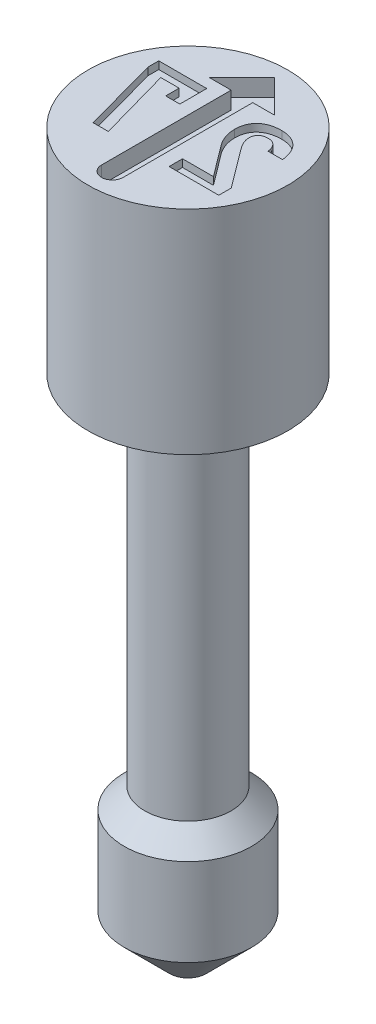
ISO-10303-21;
HEADER;
FILE_DESCRIPTION(('STEP AP214'),'2;1');
FILE_NAME('part.step','',(''),(''),'','','');
FILE_SCHEMA(('AUTOMOTIVE_DESIGN { 1 0 10303 214 1 1 1 1 }'));
ENDSEC;
DATA;
#1=APPLICATION_CONTEXT('core data for automotive mechanical design processes');
#2=APPLICATION_PROTOCOL_DEFINITION('international standard','automotive_design',2000,#1);
#3=PRODUCT_CONTEXT('',#1,'mechanical');
#4=PRODUCT('Part','Part','',(#3));
#5=PRODUCT_RELATED_PRODUCT_CATEGORY('part','',(#4));
#6=PRODUCT_DEFINITION_FORMATION('','',#4);
#7=PRODUCT_DEFINITION_CONTEXT('part definition',#1,'design');
#8=PRODUCT_DEFINITION('design','',#6,#7);
#9=PRODUCT_DEFINITION_SHAPE('','',#8);
#10=(LENGTH_UNIT() NAMED_UNIT(*) SI_UNIT(.MILLI.,.METRE.));
#11=(NAMED_UNIT(*) PLANE_ANGLE_UNIT() SI_UNIT($,.RADIAN.));
#12=(NAMED_UNIT(*) SI_UNIT($,.STERADIAN.) SOLID_ANGLE_UNIT());
#13=UNCERTAINTY_MEASURE_WITH_UNIT(LENGTH_MEASURE(1.E-05),#10,'distance_accuracy_value','');
#14=(GEOMETRIC_REPRESENTATION_CONTEXT(3) GLOBAL_UNCERTAINTY_ASSIGNED_CONTEXT((#13)) GLOBAL_UNIT_ASSIGNED_CONTEXT((#10,
#11,#12)) REPRESENTATION_CONTEXT('',''));
#15=CARTESIAN_POINT('',(0.,0.,0.));
#16=DIRECTION('',(0.,0.,1.));
#17=DIRECTION('',(1.,0.,0.));
#18=AXIS2_PLACEMENT_3D('',#15,#16,#17);
#19=CARTESIAN_POINT('',(0.,17.018,0.));
#20=DIRECTION('',(0.,1.,0.));
#21=DIRECTION('',(0.,0.,1.));
#22=AXIS2_PLACEMENT_3D('',#19,#20,#21);
#23=PLANE('',#22);
#24=DIRECTION('',(1.,0.,0.));
#25=VECTOR('',#24,1.);
#26=CARTESIAN_POINT('',(0.571912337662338,17.018,1.016));
#27=LINE('',#26,#25);
#28=CARTESIAN_POINT('',(0.571912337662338,17.018,1.016));
#29=VERTEX_POINT('',#28);
#30=CARTESIAN_POINT('',(1.74088961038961,17.018,1.016));
#31=VERTEX_POINT('',#30);
#32=EDGE_CURVE('E51',#29,#31,#27,.T.);
#33=ORIENTED_EDGE('',*,*,#32,.F.);
#34=DIRECTION('',(0.,0.,1.));
#35=VECTOR('',#34,1.);
#36=CARTESIAN_POINT('',(0.571912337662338,17.018,0.699324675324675));
#37=LINE('',#36,#35);
#38=CARTESIAN_POINT('',(0.571912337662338,17.018,0.699324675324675));
#39=VERTEX_POINT('',#38);
#40=EDGE_CURVE('E272',#39,#29,#37,.T.);
#41=ORIENTED_EDGE('',*,*,#40,.F.);
#42=DIRECTION('',(-1.,0.,0.));
#43=VECTOR('',#42,1.);
#44=CARTESIAN_POINT('',(1.29968831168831,17.018,0.699324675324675));
#45=LINE('',#44,#43);
#46=CARTESIAN_POINT('',(1.29968831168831,17.018,0.699324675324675));
#47=VERTEX_POINT('',#46);
#48=EDGE_CURVE('E275',#47,#39,#45,.T.);
#49=ORIENTED_EDGE('',*,*,#48,.F.);
#50=DIRECTION('',(0.601464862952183,0.,0.798899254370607));
#51=VECTOR('',#50,1.);
#52=CARTESIAN_POINT('',(0.758288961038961,17.018,-0.0197922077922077));
#53=LINE('',#52,#51);
#54=CARTESIAN_POINT('',(0.758288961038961,17.018,-0.0197922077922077));
#55=VERTEX_POINT('',#54);
#56=EDGE_CURVE('E587',#55,#47,#53,.T.);
#57=ORIENTED_EDGE('',*,*,#56,.F.);
#58=CARTESIAN_POINT('',(0.583045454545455,17.018,-0.508824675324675));
#59=CARTESIAN_POINT('',(0.583586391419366,17.018,-0.488036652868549));
#60=CARTESIAN_POINT('',(0.584672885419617,17.018,-0.446283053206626));
#61=CARTESIAN_POINT('',(0.594069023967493,17.018,-0.383460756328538));
#62=CARTESIAN_POINT('',(0.607637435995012,17.018,-0.319985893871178));
#63=CARTESIAN_POINT('',(0.628261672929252,17.018,-0.256774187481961));
#64=CARTESIAN_POINT('',(0.65310078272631,17.018,-0.194185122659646));
#65=CARTESIAN_POINT('',(0.683386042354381,17.018,-0.133645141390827));
#66=CARTESIAN_POINT('',(0.71794772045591,17.018,-0.0749749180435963));
#67=CARTESIAN_POINT('',(0.744778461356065,17.018,-0.0382731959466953));
#68=CARTESIAN_POINT('',(0.758288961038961,17.018,-0.0197922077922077));
#69=B_SPLINE_CURVE_WITH_KNOTS('',3,(#58,#59,#60,#61,#62,#63,#64,#65,#66,#67,#68),.UNSPECIFIED.,
.F.,.F.,(4,1,1,1,1,1,1,1,4),(0.,0.117962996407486,0.236933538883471,0.360005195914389,
0.486119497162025,0.613931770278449,0.742012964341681,0.870091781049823,1.),.UNSPECIFIED.);
#70=CARTESIAN_POINT('',(0.583045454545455,17.018,-0.508824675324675));
#71=VERTEX_POINT('',#70);
#72=EDGE_CURVE('E590',#71,#55,#69,.T.);
#73=ORIENTED_EDGE('',*,*,#72,.F.);
#74=DIRECTION('',(0.,0.,1.));
#75=VECTOR('',#74,1.);
#76=CARTESIAN_POINT('',(0.583045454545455,17.018,-0.510061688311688));
#77=LINE('',#76,#75);
#78=CARTESIAN_POINT('',(0.583045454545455,17.018,-0.510061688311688));
#79=VERTEX_POINT('',#78);
#80=EDGE_CURVE('E595',#79,#71,#77,.T.);
#81=ORIENTED_EDGE('',*,*,#80,.F.);
#82=CARTESIAN_POINT('',(1.16732792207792,17.018,-1.04238961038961));
#83=CARTESIAN_POINT('',(1.14463082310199,17.018,-1.04205905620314));
#84=CARTESIAN_POINT('',(1.10050874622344,17.018,-1.04141647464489));
#85=CARTESIAN_POINT('',(1.03643838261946,17.018,-1.03457908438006));
#86=CARTESIAN_POINT('',(0.976258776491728,17.018,-1.02407863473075));
#87=CARTESIAN_POINT('',(0.920021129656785,17.018,-1.0089138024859));
#88=CARTESIAN_POINT('',(0.867836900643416,17.018,-0.989080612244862));
#89=CARTESIAN_POINT('',(0.819657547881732,17.018,-0.964997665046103));
#90=CARTESIAN_POINT('',(0.775168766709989,17.018,-0.937016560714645));
#91=CARTESIAN_POINT('',(0.735030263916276,17.018,-0.904188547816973));
#92=CARTESIAN_POINT('',(0.699184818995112,17.018,-0.867564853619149));
#93=CARTESIAN_POINT('',(0.667824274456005,17.018,-0.827280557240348));
#94=CARTESIAN_POINT('',(0.641938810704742,17.018,-0.782987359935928));
#95=CARTESIAN_POINT('',(0.619676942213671,17.018,-0.735578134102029));
#96=CARTESIAN_POINT('',(0.603562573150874,17.018,-0.684023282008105));
#97=CARTESIAN_POINT('',(0.591433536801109,17.018,-0.629288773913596));
#98=CARTESIAN_POINT('',(0.58449216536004,17.018,-0.57085274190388));
#99=CARTESIAN_POINT('',(0.583536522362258,17.018,-0.530696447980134));
#100=CARTESIAN_POINT('',(0.583045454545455,17.018,-0.510061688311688));
#101=B_SPLINE_CURVE_WITH_KNOTS('',3,(#82,#83,#84,#85,#86,#87,#88,#89,#90,#91,#92,#93,#94,#95,
#96,#97,#98,#99,#100),.UNSPECIFIED.,.F.,.F.,(4,1,1,1,1,1,1,1,1,1,1,1,1,1,1,1,4),(0.,
0.0757177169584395,0.147191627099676,0.214761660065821,0.279410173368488,0.341256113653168,
0.400743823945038,0.458895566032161,0.516277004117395,0.573364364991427,0.629605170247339,
0.686164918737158,0.744246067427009,0.804009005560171,0.865999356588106,0.931142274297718,1.),.UNSPECIFIED.);
#102=CARTESIAN_POINT('',(1.16732792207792,17.018,-1.04238961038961));
#103=VERTEX_POINT('',#102);
#104=EDGE_CURVE('E601',#103,#79,#101,.T.);
#105=ORIENTED_EDGE('',*,*,#104,.F.);
#106=CARTESIAN_POINT('',(1.76562987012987,17.018,-0.460581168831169));
#107=CARTESIAN_POINT('',(1.76299223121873,17.018,-0.483184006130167));
#108=CARTESIAN_POINT('',(1.75784404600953,17.018,-0.52730058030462));
#109=CARTESIAN_POINT('',(1.74384154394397,17.018,-0.590874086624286));
#110=CARTESIAN_POINT('',(1.7267087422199,17.018,-0.650658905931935));
#111=CARTESIAN_POINT('',(1.7052446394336,17.018,-0.706576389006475));
#112=CARTESIAN_POINT('',(1.67963027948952,17.018,-0.758546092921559));
#113=CARTESIAN_POINT('',(1.6504377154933,17.018,-0.806952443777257));
#114=CARTESIAN_POINT('',(1.61620982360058,17.018,-0.850632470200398));
#115=CARTESIAN_POINT('',(1.57886153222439,17.018,-0.89089098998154));
#116=CARTESIAN_POINT('',(1.53743513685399,17.018,-0.926274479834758));
#117=CARTESIAN_POINT('',(1.49313427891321,17.018,-0.957382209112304));
#118=CARTESIAN_POINT('',(1.44596817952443,17.018,-0.983940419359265));
#119=CARTESIAN_POINT('',(1.39578374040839,17.018,-1.00548058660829));
#120=CARTESIAN_POINT('',(1.34265845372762,17.018,-1.02187735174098));
#121=CARTESIAN_POINT('',(1.28680347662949,17.018,-1.03390789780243));
#122=CARTESIAN_POINT('',(1.22798279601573,17.018,-1.04092463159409));
#123=CARTESIAN_POINT('',(1.1878260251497,17.018,-1.04189452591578));
#124=CARTESIAN_POINT('',(1.16732792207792,17.018,-1.04238961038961));
#125=B_SPLINE_CURVE_WITH_KNOTS('',3,(#106,#107,#108,#109,#110,#111,#112,#113,#114,#115,#116,
#117,#118,#119,#120,#121,#122,#123,#124),.UNSPECIFIED.,.F.,.F.,(4,1,1,1,1,1,1,1,1,1,1,1,1,1,1,1,
4),(0.,0.0735286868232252,0.143514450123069,0.210169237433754,0.274454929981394,
0.336856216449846,0.397291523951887,0.456843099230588,0.515945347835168,0.574554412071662,
0.632618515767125,0.690713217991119,0.749236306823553,0.808827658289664,0.870185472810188,
0.9337359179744,1.),.UNSPECIFIED.);
#126=CARTESIAN_POINT('',(1.76562987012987,17.018,-0.460581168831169));
#127=VERTEX_POINT('',#126);
#128=EDGE_CURVE('E606',#127,#103,#125,.T.);
#129=ORIENTED_EDGE('',*,*,#128,.F.);
#130=DIRECTION('',(0.,0.,-1.));
#131=VECTOR('',#130,1.);
#132=CARTESIAN_POINT('',(1.76562987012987,17.018,-0.459344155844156));
#133=LINE('',#132,#131);
#134=CARTESIAN_POINT('',(1.76562987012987,17.018,-0.459344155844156));
#135=VERTEX_POINT('',#134);
#136=EDGE_CURVE('E614',#135,#127,#133,.T.);
#137=ORIENTED_EDGE('',*,*,#136,.F.);
#138=DIRECTION('',(1.,0.,0.));
#139=VECTOR('',#138,1.);
#140=CARTESIAN_POINT('',(1.42338961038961,17.018,-0.459344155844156));
#141=LINE('',#140,#139);
#142=CARTESIAN_POINT('',(1.42338961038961,17.018,-0.459344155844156));
#143=VERTEX_POINT('',#142);
#144=EDGE_CURVE('E620',#143,#135,#141,.T.);
#145=ORIENTED_EDGE('',*,*,#144,.F.);
#146=DIRECTION('',(0.,0.,1.));
#147=VECTOR('',#146,1.);
#148=CARTESIAN_POINT('',(1.42338961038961,17.018,-0.460581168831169));
#149=LINE('',#148,#147);
#150=CARTESIAN_POINT('',(1.42338961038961,17.018,-0.460581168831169));
#151=VERTEX_POINT('',#150);
#152=EDGE_CURVE('E623',#151,#143,#149,.T.);
#153=ORIENTED_EDGE('',*,*,#152,.F.);
#154=CARTESIAN_POINT('',(1.16444155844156,17.018,-0.725714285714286));
#155=CARTESIAN_POINT('',(1.18158948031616,17.018,-0.725074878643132));
#156=CARTESIAN_POINT('',(1.21479350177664,17.018,-0.723836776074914));
#157=CARTESIAN_POINT('',(1.26192448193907,17.018,-0.709847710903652));
#158=CARTESIAN_POINT('',(1.30465343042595,17.018,-0.688354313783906));
#159=CARTESIAN_POINT('',(1.34147193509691,17.018,-0.657296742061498));
#160=CARTESIAN_POINT('',(1.37241700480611,17.018,-0.618583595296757));
#161=CARTESIAN_POINT('',(1.39694780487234,17.018,-0.572517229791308));
#162=CARTESIAN_POINT('',(1.4141220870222,17.018,-0.518966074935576));
#163=CARTESIAN_POINT('',(1.42020857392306,17.018,-0.480621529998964));
#164=CARTESIAN_POINT('',(1.42338961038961,17.018,-0.460581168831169));
#165=B_SPLINE_CURVE_WITH_KNOTS('',3,(#154,#155,#156,#157,#158,#159,#160,#161,#162,#163,#164),
.UNSPECIFIED.,.F.,.F.,(4,1,1,1,1,1,1,1,4),(0.,0.124986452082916,0.242014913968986,
0.356148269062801,0.472436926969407,0.591058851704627,0.716468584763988,0.851815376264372,1.),.UNSPECIFIED.);
#166=CARTESIAN_POINT('',(1.16444155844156,17.018,-0.725714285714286));
#167=VERTEX_POINT('',#166);
#168=EDGE_CURVE('E626',#167,#151,#165,.T.);
#169=ORIENTED_EDGE('',*,*,#168,.F.);
#170=CARTESIAN_POINT('',(0.926522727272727,17.018,-0.510061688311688));
#171=CARTESIAN_POINT('',(0.927078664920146,17.018,-0.526368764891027));
#172=CARTESIAN_POINT('',(0.928141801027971,17.018,-0.557553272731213));
#173=CARTESIAN_POINT('',(0.940472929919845,17.018,-0.601204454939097));
#174=CARTESIAN_POINT('',(0.960073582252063,17.018,-0.639185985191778));
#175=CARTESIAN_POINT('',(0.988022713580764,17.018,-0.670613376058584));
#176=CARTESIAN_POINT('',(1.02279637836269,17.018,-0.69562289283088));
#177=CARTESIAN_POINT('',(1.06434206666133,17.018,-0.713667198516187));
#178=CARTESIAN_POINT('',(1.11243653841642,17.018,-0.723610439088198));
#179=CARTESIAN_POINT('',(1.14652803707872,17.018,-0.724989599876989));
#180=CARTESIAN_POINT('',(1.16444155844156,17.018,-0.725714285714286));
#181=B_SPLINE_CURVE_WITH_KNOTS('',3,(#170,#171,#172,#173,#174,#175,#176,#177,#178,#179,#180),
.UNSPECIFIED.,.F.,.F.,(4,1,1,1,1,1,1,1,4),(0.,0.133827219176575,0.255921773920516,
0.369738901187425,0.482715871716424,0.598532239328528,0.719553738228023,0.852638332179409,1.),.UNSPECIFIED.);
#182=CARTESIAN_POINT('',(0.926522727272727,17.018,-0.510061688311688));
#183=VERTEX_POINT('',#182);
#184=EDGE_CURVE('E631',#183,#167,#181,.T.);
#185=ORIENTED_EDGE('',*,*,#184,.F.);
#186=DIRECTION('',(0.,0.,-1.));
#187=VECTOR('',#186,1.);
#188=CARTESIAN_POINT('',(0.926522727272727,17.018,-0.507175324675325));
#189=LINE('',#188,#187);
#190=CARTESIAN_POINT('',(0.926522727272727,17.018,-0.507175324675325));
#191=VERTEX_POINT('',#190);
#192=EDGE_CURVE('E639',#191,#183,#189,.T.);
#193=ORIENTED_EDGE('',*,*,#192,.F.);
#194=CARTESIAN_POINT('',(1.04074025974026,17.018,-0.215652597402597));
#195=CARTESIAN_POINT('',(1.03207600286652,17.018,-0.227648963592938));
#196=CARTESIAN_POINT('',(1.01499091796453,17.018,-0.251304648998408));
#197=CARTESIAN_POINT('',(0.992128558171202,17.018,-0.288084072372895));
#198=CARTESIAN_POINT('',(0.972869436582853,17.018,-0.325721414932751));
#199=CARTESIAN_POINT('',(0.956261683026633,17.018,-0.363521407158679));
#200=CARTESIAN_POINT('',(0.943253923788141,17.018,-0.401045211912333));
#201=CARTESIAN_POINT('',(0.933426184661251,17.018,-0.437499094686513));
#202=CARTESIAN_POINT('',(0.928004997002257,17.018,-0.472789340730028));
#203=CARTESIAN_POINT('',(0.927009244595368,17.018,-0.495889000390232));
#204=CARTESIAN_POINT('',(0.926522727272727,17.018,-0.507175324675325));
#205=B_SPLINE_CURVE_WITH_KNOTS('',3,(#194,#195,#196,#197,#198,#199,#200,#201,#202,#203,#204),
.UNSPECIFIED.,.F.,.F.,(4,1,1,1,1,1,1,1,4),(0.,0.139527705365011,0.275135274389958,
0.407888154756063,0.537917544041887,0.66417107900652,0.782063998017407,0.893518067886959,1.),.UNSPECIFIED.);
#206=CARTESIAN_POINT('',(1.04074025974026,17.018,-0.215652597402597));
#207=VERTEX_POINT('',#206);
#208=EDGE_CURVE('E645',#207,#191,#205,.T.);
#209=ORIENTED_EDGE('',*,*,#208,.F.);
#210=DIRECTION('',(-0.597969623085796,0.,-0.801518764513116));
#211=VECTOR('',#210,1.);
#212=CARTESIAN_POINT('',(1.74088961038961,17.018,0.722827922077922));
#213=LINE('',#212,#211);
#214=CARTESIAN_POINT('',(1.74088961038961,17.018,0.722827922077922));
#215=VERTEX_POINT('',#214);
#216=EDGE_CURVE('E650',#215,#207,#213,.T.);
#217=ORIENTED_EDGE('',*,*,#216,.F.);
#218=DIRECTION('',(0.,0.,-1.));
#219=VECTOR('',#218,1.);
#220=CARTESIAN_POINT('',(1.74088961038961,17.018,1.016));
#221=LINE('',#220,#219);
#222=EDGE_CURVE('E656',#31,#215,#221,.T.);
#223=ORIENTED_EDGE('',*,*,#222,.F.);
#224=EDGE_LOOP('',(#33,#41,#49,#57,#73,#81,#105,#129,#137,#145,#153,#169,#185,#193,#209,#217,#223));
#225=FACE_BOUND('',#224,.T.);
#226=DIRECTION('',(-1.,0.,0.));
#227=VECTOR('',#226,1.);
#228=CARTESIAN_POINT('',(-0.574072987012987,17.018,-1.016));
#229=LINE('',#228,#227);
#230=CARTESIAN_POINT('',(-0.574072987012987,17.018,-1.016));
#231=VERTEX_POINT('',#230);
#232=CARTESIAN_POINT('',(-1.70264116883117,17.018,-1.016));
#233=VERTEX_POINT('',#232);
#234=EDGE_CURVE('E59',#231,#233,#229,.T.);
#235=ORIENTED_EDGE('',*,*,#234,.F.);
#236=DIRECTION('',(0.,0.,-1.));
#237=VECTOR('',#236,1.);
#238=CARTESIAN_POINT('',(-0.574072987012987,17.018,-0.382649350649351));
#239=LINE('',#238,#237);
#240=CARTESIAN_POINT('',(-0.574072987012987,17.018,-0.382649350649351));
#241=VERTEX_POINT('',#240);
#242=EDGE_CURVE('E504',#241,#231,#239,.T.);
#243=ORIENTED_EDGE('',*,*,#242,.F.);
#244=DIRECTION('',(1.,0.,0.));
#245=VECTOR('',#244,1.);
#246=CARTESIAN_POINT('',(-0.906417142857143,17.018,-0.382649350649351));
#247=LINE('',#246,#245);
#248=CARTESIAN_POINT('',(-0.906417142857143,17.018,-0.382649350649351));
#249=VERTEX_POINT('',#248);
#250=EDGE_CURVE('E508',#249,#241,#247,.T.);
#251=ORIENTED_EDGE('',*,*,#250,.F.);
#252=DIRECTION('',(0.,0.,1.));
#253=VECTOR('',#252,1.);
#254=CARTESIAN_POINT('',(-0.906417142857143,17.018,-0.699324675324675));
#255=LINE('',#254,#253);
#256=CARTESIAN_POINT('',(-0.906417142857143,17.018,-0.699324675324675));
#257=VERTEX_POINT('',#256);
#258=EDGE_CURVE('E511',#257,#249,#255,.T.);
#259=ORIENTED_EDGE('',*,*,#258,.F.);
#260=DIRECTION('',(1.,0.,0.));
#261=VECTOR('',#260,1.);
#262=CARTESIAN_POINT('',(-1.33772233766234,17.018,-0.699324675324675));
#263=LINE('',#262,#261);
#264=CARTESIAN_POINT('',(-1.33772233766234,17.018,-0.699324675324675));
#265=VERTEX_POINT('',#264);
#266=EDGE_CURVE('E514',#265,#257,#263,.T.);
#267=ORIENTED_EDGE('',*,*,#266,.F.);
#268=DIRECTION('',(-0.270102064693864,0.,-0.962831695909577));
#269=VECTOR('',#268,1.);
#270=CARTESIAN_POINT('',(-0.856524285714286,17.018,1.016));
#271=LINE('',#270,#269);
#272=CARTESIAN_POINT('',(-0.856524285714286,17.018,1.016));
#273=VERTEX_POINT('',#272);
#274=EDGE_CURVE('E517',#273,#265,#271,.T.);
#275=ORIENTED_EDGE('',*,*,#274,.F.);
#276=DIRECTION('',(1.,0.,0.));
#277=VECTOR('',#276,1.);
#278=CARTESIAN_POINT('',(-1.21402103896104,17.018,1.016));
#279=LINE('',#278,#277);
#280=CARTESIAN_POINT('',(-1.21402103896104,17.018,1.016));
#281=VERTEX_POINT('',#280);
#282=EDGE_CURVE('E520',#281,#273,#279,.T.);
#283=ORIENTED_EDGE('',*,*,#282,.F.);
#284=DIRECTION('',(0.264647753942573,0.,0.964345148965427));
#285=VECTOR('',#284,1.);
#286=CARTESIAN_POINT('',(-1.70264116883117,17.018,-0.764474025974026));
#287=LINE('',#286,#285);
#288=CARTESIAN_POINT('',(-1.70264116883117,17.018,-0.764474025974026));
#289=VERTEX_POINT('',#288);
#290=EDGE_CURVE('E523',#289,#281,#287,.T.);
#291=ORIENTED_EDGE('',*,*,#290,.F.);
#292=DIRECTION('',(0.,0.,1.));
#293=VECTOR('',#292,1.);
#294=CARTESIAN_POINT('',(-1.70264116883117,17.018,-1.016));
#295=LINE('',#294,#293);
#296=EDGE_CURVE('E526',#233,#289,#295,.T.);
#297=ORIENTED_EDGE('',*,*,#296,.F.);
#298=EDGE_LOOP('',(#235,#243,#251,#259,#267,#275,#283,#291,#297));
#299=FACE_BOUND('',#298,.T.);
#300=CARTESIAN_POINT('',(0.,17.018,1.778));
#301=DIRECTION('',(0.,1.,0.));
#302=DIRECTION('',(0.,0.,1.));
#303=AXIS2_PLACEMENT_3D('',#300,#301,#302);
#304=CIRCLE('',#303,0.254);
#305=CARTESIAN_POINT('',(-0.254,17.018,1.778));
#306=VERTEX_POINT('',#305);
#307=CARTESIAN_POINT('',(0.254,17.018,1.778));
#308=VERTEX_POINT('',#307);
#309=EDGE_CURVE('E463',#306,#308,#304,.T.);
#310=ORIENTED_EDGE('',*,*,#309,.F.);
#311=DIRECTION('',(0.,0.,1.));
#312=VECTOR('',#311,1.);
#313=CARTESIAN_POINT('',(-0.254,17.018,1.778));
#314=LINE('',#313,#312);
#315=CARTESIAN_POINT('',(-0.254,17.018,-1.27));
#316=VERTEX_POINT('',#315);
#317=EDGE_CURVE('E444',#316,#306,#314,.T.);
#318=ORIENTED_EDGE('',*,*,#317,.F.);
#319=DIRECTION('',(1.,0.,0.));
#320=VECTOR('',#319,1.);
#321=CARTESIAN_POINT('',(-0.254,17.018,-1.27));
#322=LINE('',#321,#320);
#323=CARTESIAN_POINT('',(-0.762,17.018,-1.27));
#324=VERTEX_POINT('',#323);
#325=EDGE_CURVE('E448',#324,#316,#322,.T.);
#326=ORIENTED_EDGE('',*,*,#325,.F.);
#327=DIRECTION('',(-0.707106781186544,0.,0.707106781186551));
#328=VECTOR('',#327,1.);
#329=CARTESIAN_POINT('',(0.,17.018,-2.03200000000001));
#330=LINE('',#329,#328);
#331=CARTESIAN_POINT('',(0.,17.018,-2.03200000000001));
#332=VERTEX_POINT('',#331);
#333=EDGE_CURVE('E451',#332,#324,#330,.T.);
#334=ORIENTED_EDGE('',*,*,#333,.F.);
#335=DIRECTION('',(-0.707106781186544,0.,-0.707106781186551));
#336=VECTOR('',#335,1.);
#337=CARTESIAN_POINT('',(0.762,17.018,-1.27));
#338=LINE('',#337,#336);
#339=CARTESIAN_POINT('',(0.762,17.018,-1.27));
#340=VERTEX_POINT('',#339);
#341=EDGE_CURVE('E454',#340,#332,#338,.T.);
#342=ORIENTED_EDGE('',*,*,#341,.F.);
#343=DIRECTION('',(1.,0.,0.));
#344=VECTOR('',#343,1.);
#345=CARTESIAN_POINT('',(0.254,17.018,-1.27));
#346=LINE('',#345,#344);
#347=CARTESIAN_POINT('',(0.254,17.018,-1.27));
#348=VERTEX_POINT('',#347);
#349=EDGE_CURVE('E457',#348,#340,#346,.T.);
#350=ORIENTED_EDGE('',*,*,#349,.F.);
#351=DIRECTION('',(0.,0.,-1.));
#352=VECTOR('',#351,1.);
#353=CARTESIAN_POINT('',(0.254,17.018,1.778));
#354=LINE('',#353,#352);
#355=EDGE_CURVE('E460',#308,#348,#354,.T.);
#356=ORIENTED_EDGE('',*,*,#355,.F.);
#357=EDGE_LOOP('',(#310,#318,#326,#334,#342,#350,#356));
#358=FACE_BOUND('',#357,.T.);
#359=CARTESIAN_POINT('',(0.,17.018,0.));
#360=DIRECTION('',(0.,-1.,0.));
#361=DIRECTION('',(0.,0.,-1.));
#362=AXIS2_PLACEMENT_3D('',#359,#360,#361);
#363=CIRCLE('',#362,2.3495);
#364=CARTESIAN_POINT('',(0.,17.018,-2.3495));
#365=VERTEX_POINT('',#364);
#366=EDGE_CURVE('E11',#365,#365,#363,.T.);
#367=ORIENTED_EDGE('',*,*,#366,.F.);
#368=EDGE_LOOP('',(#367));
#369=FACE_BOUND('',#368,.T.);
#370=ADVANCED_FACE('F37',(#225,#299,#358,#369),#23,.T.);
#371=CARTESIAN_POINT('',(0.,0.,0.));
#372=DIRECTION('',(0.,-1.,0.));
#373=DIRECTION('',(0.,0.,-1.));
#374=AXIS2_PLACEMENT_3D('',#371,#372,#373);
#375=CYLINDRICAL_SURFACE('',#374,2.3495);
#376=ORIENTED_EDGE('',*,*,#366,.T.);
#377=EDGE_LOOP('',(#376));
#378=FACE_BOUND('',#377,.T.);
#379=CARTESIAN_POINT('',(0.,12.0142,0.));
#380=DIRECTION('',(0.,-1.,0.));
#381=DIRECTION('',(0.,0.,-1.));
#382=AXIS2_PLACEMENT_3D('',#379,#380,#381);
#383=CIRCLE('',#382,2.3495);
#384=CARTESIAN_POINT('',(0.,12.0142,-2.3495));
#385=VERTEX_POINT('',#384);
#386=EDGE_CURVE('E44',#385,#385,#383,.T.);
#387=ORIENTED_EDGE('',*,*,#386,.F.);
#388=EDGE_LOOP('',(#387));
#389=FACE_BOUND('',#388,.T.);
#390=ADVANCED_FACE('F400',(#378,#389),#375,.T.);
#391=CARTESIAN_POINT('',(2.3495,12.0142,0.));
#392=DIRECTION('',(0.,-1.,0.));
#393=DIRECTION('',(0.,0.,-1.));
#394=AXIS2_PLACEMENT_3D('',#391,#392,#393);
#395=PLANE('',#394);
#396=ORIENTED_EDGE('',*,*,#386,.T.);
#397=EDGE_LOOP('',(#396));
#398=FACE_BOUND('',#397,.T.);
#399=CARTESIAN_POINT('',(0.,12.0142,0.));
#400=DIRECTION('',(0.,-1.,0.));
#401=DIRECTION('',(0.,0.,-1.));
#402=AXIS2_PLACEMENT_3D('',#399,#400,#401);
#403=CIRCLE('',#402,1.016);
#404=CARTESIAN_POINT('',(0.,12.0142,-1.016));
#405=VERTEX_POINT('',#404);
#406=EDGE_CURVE('E412',#405,#405,#403,.T.);
#407=ORIENTED_EDGE('',*,*,#406,.F.);
#408=EDGE_LOOP('',(#407));
#409=FACE_BOUND('',#408,.T.);
#410=ADVANCED_FACE('F397',(#398,#409),#395,.T.);
#411=CARTESIAN_POINT('',(0.,0.,0.));
#412=DIRECTION('',(0.,-1.,0.));
#413=DIRECTION('',(0.,0.,-1.));
#414=AXIS2_PLACEMENT_3D('',#411,#412,#413);
#415=CYLINDRICAL_SURFACE('',#414,1.016);
#416=ORIENTED_EDGE('',*,*,#406,.T.);
#417=EDGE_LOOP('',(#416));
#418=FACE_BOUND('',#417,.T.);
#419=CARTESIAN_POINT('',(0.,3.6068,0.));
#420=DIRECTION('',(0.,-1.,0.));
#421=DIRECTION('',(0.,0.,-1.));
#422=AXIS2_PLACEMENT_3D('',#419,#420,#421);
#423=CIRCLE('',#422,1.016);
#424=CARTESIAN_POINT('',(0.,3.6068,-1.016));
#425=VERTEX_POINT('',#424);
#426=EDGE_CURVE('E414',#425,#425,#423,.T.);
#427=ORIENTED_EDGE('',*,*,#426,.F.);
#428=EDGE_LOOP('',(#427));
#429=FACE_BOUND('',#428,.T.);
#430=ADVANCED_FACE('F393',(#418,#429),#415,.T.);
#431=CARTESIAN_POINT('',(0.,3.12420000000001,0.));
#432=DIRECTION('',(0.,-1.,0.));
#433=DIRECTION('',(0.,0.,-1.));
#434=AXIS2_PLACEMENT_3D('',#431,#432,#433);
#435=CONICAL_SURFACE('',#434,1.4986,0.785398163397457);
#436=ORIENTED_EDGE('',*,*,#426,.T.);
#437=EDGE_LOOP('',(#436));
#438=FACE_BOUND('',#437,.T.);
#439=CARTESIAN_POINT('',(0.,3.12420000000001,0.));
#440=DIRECTION('',(0.,-1.,0.));
#441=DIRECTION('',(0.,0.,-1.));
#442=AXIS2_PLACEMENT_3D('',#439,#440,#441);
#443=CIRCLE('',#442,1.4986);
#444=CARTESIAN_POINT('',(0.,3.12420000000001,-1.4986));
#445=VERTEX_POINT('',#444);
#446=EDGE_CURVE('E419',#445,#445,#443,.T.);
#447=ORIENTED_EDGE('',*,*,#446,.F.);
#448=EDGE_LOOP('',(#447));
#449=FACE_BOUND('',#448,.T.);
#450=ADVANCED_FACE('F389',(#438,#449),#435,.T.);
#451=CARTESIAN_POINT('',(0.,0.,0.));
#452=DIRECTION('',(0.,-1.,0.));
#453=DIRECTION('',(0.,0.,-1.));
#454=AXIS2_PLACEMENT_3D('',#451,#452,#453);
#455=CYLINDRICAL_SURFACE('',#454,1.4986);
#456=ORIENTED_EDGE('',*,*,#446,.T.);
#457=EDGE_LOOP('',(#456));
#458=FACE_BOUND('',#457,.T.);
#459=CARTESIAN_POINT('',(0.,1.0668,0.));
#460=DIRECTION('',(0.,-1.,0.));
#461=DIRECTION('',(0.,0.,-1.));
#462=AXIS2_PLACEMENT_3D('',#459,#460,#461);
#463=CIRCLE('',#462,1.4986);
#464=CARTESIAN_POINT('',(0.,1.0668,1.4986));
#465=VERTEX_POINT('',#464);
#466=EDGE_CURVE('E422',#465,#465,#463,.T.);
#467=ORIENTED_EDGE('',*,*,#466,.F.);
#468=EDGE_LOOP('',(#467));
#469=FACE_BOUND('',#468,.T.);
#470=ADVANCED_FACE('F385',(#458,#469),#455,.T.);
#471=CARTESIAN_POINT('',(0.,0.,0.));
#472=DIRECTION('',(0.,1.,0.));
#473=DIRECTION('',(0.,0.,1.));
#474=AXIS2_PLACEMENT_3D('',#471,#472,#473);
#475=CONICAL_SURFACE('',#474,0.431800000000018,0.78539816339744);
#476=CARTESIAN_POINT('',(0.,0.,0.));
#477=DIRECTION('',(0.,-1.,0.));
#478=DIRECTION('',(0.,0.,-1.));
#479=AXIS2_PLACEMENT_3D('',#476,#477,#478);
#480=CIRCLE('',#479,0.431800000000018);
#481=CARTESIAN_POINT('',(0.,0.,0.431800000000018));
#482=VERTEX_POINT('',#481);
#483=EDGE_CURVE('E425',#482,#482,#480,.T.);
#484=CARTESIAN_POINT('',(0.,1.0668,1.4986));
#485=CARTESIAN_POINT('',(0.,1.0556875,1.4874875));
#486=CARTESIAN_POINT('',(0.,1.044575,1.476375));
#487=CARTESIAN_POINT('',(0.,1.02235,1.45415));
#488=CARTESIAN_POINT('',(0.,1.0112375,1.4430375));
#489=CARTESIAN_POINT('',(0.,0.9890125,1.4208125));
#490=CARTESIAN_POINT('',(0.,0.977900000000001,1.4097));
#491=CARTESIAN_POINT('',(0.,0.955675,1.387475));
#492=CARTESIAN_POINT('',(0.,0.944562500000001,1.3763625));
#493=CARTESIAN_POINT('',(0.,0.9223375,1.3541375));
#494=CARTESIAN_POINT('',(0.,0.911225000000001,1.343025));
#495=CARTESIAN_POINT('',(0.,0.889,1.3208));
#496=CARTESIAN_POINT('',(0.,0.8778875,1.3096875));
#497=CARTESIAN_POINT('',(0.,0.8556625,1.2874625));
#498=CARTESIAN_POINT('',(0.,0.84455,1.27635));
#499=CARTESIAN_POINT('',(0.,0.822325,1.254125));
#500=CARTESIAN_POINT('',(0.,0.8112125,1.2430125));
#501=CARTESIAN_POINT('',(0.,0.7889875,1.2207875));
#502=CARTESIAN_POINT('',(0.,0.777875,1.20967500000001));
#503=CARTESIAN_POINT('',(0.,0.75565,1.18745000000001));
#504=CARTESIAN_POINT('',(0.,0.744537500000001,1.17633750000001));
#505=CARTESIAN_POINT('',(0.,0.7223125,1.15411250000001));
#506=CARTESIAN_POINT('',(0.,0.7112,1.14300000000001));
#507=CARTESIAN_POINT('',(0.,0.688975,1.12077500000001));
#508=CARTESIAN_POINT('',(0.,0.6778625,1.10966250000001));
#509=CARTESIAN_POINT('',(0.,0.6556375,1.08743750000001));
#510=CARTESIAN_POINT('',(0.,0.644525,1.07632500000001));
#511=CARTESIAN_POINT('',(0.,0.6223,1.05410000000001));
#512=CARTESIAN_POINT('',(0.,0.6111875,1.04298750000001));
#513=CARTESIAN_POINT('',(0.,0.5889625,1.02076250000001));
#514=CARTESIAN_POINT('',(0.,0.57785,1.00965000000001));
#515=CARTESIAN_POINT('',(0.,0.555625,0.987425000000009));
#516=CARTESIAN_POINT('',(0.,0.5445125,0.976312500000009));
#517=CARTESIAN_POINT('',(0.,0.5222875,0.954087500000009));
#518=CARTESIAN_POINT('',(0.,0.511175,0.94297500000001));
#519=CARTESIAN_POINT('',(0.,0.48895,0.92075000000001));
#520=CARTESIAN_POINT('',(0.,0.4778375,0.90963750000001));
#521=CARTESIAN_POINT('',(0.,0.4556125,0.88741250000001));
#522=CARTESIAN_POINT('',(0.,0.4445,0.876300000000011));
#523=CARTESIAN_POINT('',(0.,0.422275,0.854075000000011));
#524=CARTESIAN_POINT('',(0.,0.4111625,0.842962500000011));
#525=CARTESIAN_POINT('',(0.,0.3889375,0.820737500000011));
#526=CARTESIAN_POINT('',(0.,0.377825,0.809625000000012));
#527=CARTESIAN_POINT('',(0.,0.3556,0.787400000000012));
#528=CARTESIAN_POINT('',(0.,0.3444875,0.776287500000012));
#529=CARTESIAN_POINT('',(0.,0.3222625,0.754062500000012));
#530=CARTESIAN_POINT('',(0.,0.31115,0.742950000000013));
#531=CARTESIAN_POINT('',(0.,0.288925,0.720725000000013));
#532=CARTESIAN_POINT('',(0.,0.2778125,0.709612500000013));
#533=CARTESIAN_POINT('',(0.,0.2555875,0.687387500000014));
#534=CARTESIAN_POINT('',(0.,0.244475,0.676275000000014));
#535=CARTESIAN_POINT('',(0.,0.22225,0.654050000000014));
#536=CARTESIAN_POINT('',(0.,0.2111375,0.642937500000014));
#537=CARTESIAN_POINT('',(0.,0.1889125,0.620712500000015));
#538=CARTESIAN_POINT('',(0.,0.1778,0.609600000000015));
#539=CARTESIAN_POINT('',(0.,0.155575,0.587375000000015));
#540=CARTESIAN_POINT('',(0.,0.1444625,0.576262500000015));
#541=CARTESIAN_POINT('',(0.,0.1222375,0.554037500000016));
#542=CARTESIAN_POINT('',(0.,0.111125,0.542925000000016));
#543=CARTESIAN_POINT('',(0.,0.0889,0.520700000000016));
#544=CARTESIAN_POINT('',(0.,0.0777875,0.509587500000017));
#545=CARTESIAN_POINT('',(0.,0.0555625,0.487362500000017));
#546=CARTESIAN_POINT('',(0.,0.04445,0.476250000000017));
#547=CARTESIAN_POINT('',(0.,0.022225,0.454025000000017));
#548=CARTESIAN_POINT('',(0.,0.0111125,0.442912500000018));
#549=CARTESIAN_POINT('',(0.,0.,0.431800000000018));
#550=B_SPLINE_CURVE_WITH_KNOTS('',3,(#484,#485,#486,#487,#488,#489,#490,#491,#492,#493,#494,
#495,#496,#497,#498,#499,#500,#501,#502,#503,#504,#505,#506,#507,#508,#509,#510,#511,#512,#513,
#514,#515,#516,#517,#518,#519,#520,#521,#522,#523,#524,#525,#526,#527,#528,#529,#530,#531,#532,
#533,#534,#535,#536,#537,#538,#539,#540,#541,#542,#543,#544,#545,#546,#547,#548,#549),
.UNSPECIFIED.,.F.,.F.,(4,2,2,2,2,2,2,2,2,2,2,2,2,2,2,2,2,2,2,2,2,2,2,2,2,2,2,2,2,2,2,2,4),(0.,
0.0471463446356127,0.0942926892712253,0.141439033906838,0.188585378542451,0.235731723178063,
0.282878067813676,0.330024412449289,0.377170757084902,0.424317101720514,0.471463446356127,
0.51860979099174,0.565756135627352,0.612902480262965,0.660048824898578,0.70719516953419,
0.754341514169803,0.801487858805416,0.848634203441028,0.895780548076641,0.942926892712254,
0.990073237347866,1.03721958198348,1.08436592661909,1.1315122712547,1.17865861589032,
1.22580496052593,1.27295130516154,1.32009764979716,1.36724399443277,1.41439033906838,
1.46153668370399,1.50868302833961),.UNSPECIFIED.);
#551=EDGE_CURVE('BSEAM381',#465,#482,#550,.T.);
#552=ORIENTED_EDGE('',*,*,#466,.T.);
#553=ORIENTED_EDGE('',*,*,#483,.F.);
#554=ORIENTED_EDGE('',*,*,#551,.T.);
#555=ORIENTED_EDGE('',*,*,#551,.F.);
#556=EDGE_LOOP('',(#552,#554,#553,#555));
#557=FACE_BOUND('',#556,.T.);
#558=ADVANCED_FACE('F381',(#557),#475,.T.);
#559=CARTESIAN_POINT('',(0.431800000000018,0.,0.));
#560=DIRECTION('',(0.,-1.,0.));
#561=DIRECTION('',(0.,0.,-1.));
#562=AXIS2_PLACEMENT_3D('',#559,#560,#561);
#563=PLANE('',#562);
#564=ORIENTED_EDGE('',*,*,#483,.T.);
#565=EDGE_LOOP('',(#564));
#566=FACE_BOUND('',#565,.T.);
#567=ADVANCED_FACE('F377',(#566),#563,.T.);
#568=CARTESIAN_POINT('',(0.,16.6116,1.778));
#569=DIRECTION('',(0.,1.,0.));
#570=DIRECTION('',(0.,0.,1.));
#571=AXIS2_PLACEMENT_3D('',#568,#569,#570);
#572=CYLINDRICAL_SURFACE('',#571,0.254);
#573=ORIENTED_EDGE('',*,*,#309,.T.);
#574=DIRECTION('',(0.,1.,0.));
#575=VECTOR('',#574,1.);
#576=CARTESIAN_POINT('',(0.254,16.6116,1.778));
#577=LINE('',#576,#575);
#578=CARTESIAN_POINT('',(0.254,16.6116,1.778));
#579=VERTEX_POINT('',#578);
#580=EDGE_CURVE('E429',#579,#308,#577,.T.);
#581=ORIENTED_EDGE('',*,*,#580,.F.);
#582=CARTESIAN_POINT('',(0.,16.6116,1.778));
#583=DIRECTION('',(0.,1.,0.));
#584=DIRECTION('',(0.,0.,1.));
#585=AXIS2_PLACEMENT_3D('',#582,#583,#584);
#586=CIRCLE('',#585,0.254);
#587=CARTESIAN_POINT('',(-0.254,16.6116,1.778));
#588=VERTEX_POINT('',#587);
#589=EDGE_CURVE('E447',#588,#579,#586,.T.);
#590=ORIENTED_EDGE('',*,*,#589,.F.);
#591=DIRECTION('',(0.,1.,0.));
#592=VECTOR('',#591,1.);
#593=CARTESIAN_POINT('',(-0.254,16.6116,1.778));
#594=LINE('',#593,#592);
#595=EDGE_CURVE('E428',#588,#306,#594,.T.);
#596=ORIENTED_EDGE('',*,*,#595,.T.);
#597=EDGE_LOOP('',(#573,#581,#590,#596));
#598=FACE_BOUND('',#597,.T.);
#599=ADVANCED_FACE('F355',(#598),#572,.F.);
#600=CARTESIAN_POINT('',(-0.254,16.6116,1.778));
#601=DIRECTION('',(-1.,0.,0.));
#602=DIRECTION('',(0.,0.,1.));
#603=AXIS2_PLACEMENT_3D('',#600,#601,#602);
#604=PLANE('',#603);
#605=ORIENTED_EDGE('',*,*,#317,.T.);
#606=ORIENTED_EDGE('',*,*,#595,.F.);
#607=DIRECTION('',(0.,0.,1.));
#608=VECTOR('',#607,1.);
#609=CARTESIAN_POINT('',(-0.254,16.6116,1.778));
#610=LINE('',#609,#608);
#611=CARTESIAN_POINT('',(-0.254,16.6116,-1.27));
#612=VERTEX_POINT('',#611);
#613=EDGE_CURVE('E433',#612,#588,#610,.T.);
#614=ORIENTED_EDGE('',*,*,#613,.F.);
#615=DIRECTION('',(0.,1.,0.));
#616=VECTOR('',#615,1.);
#617=CARTESIAN_POINT('',(-0.254,16.6116,-1.27));
#618=LINE('',#617,#616);
#619=EDGE_CURVE('E441',#612,#316,#618,.T.);
#620=ORIENTED_EDGE('',*,*,#619,.T.);
#621=EDGE_LOOP('',(#605,#606,#614,#620));
#622=FACE_BOUND('',#621,.T.);
#623=ADVANCED_FACE('F351',(#622),#604,.F.);
#624=CARTESIAN_POINT('',(-0.254,16.6116,-1.27));
#625=DIRECTION('',(0.,0.,1.));
#626=DIRECTION('',(1.,0.,0.));
#627=AXIS2_PLACEMENT_3D('',#624,#625,#626);
#628=PLANE('',#627);
#629=ORIENTED_EDGE('',*,*,#325,.T.);
#630=ORIENTED_EDGE('',*,*,#619,.F.);
#631=DIRECTION('',(1.,0.,0.));
#632=VECTOR('',#631,1.);
#633=CARTESIAN_POINT('',(-0.254,16.6116,-1.27));
#634=LINE('',#633,#632);
#635=CARTESIAN_POINT('',(-0.762,16.6116,-1.27));
#636=VERTEX_POINT('',#635);
#637=EDGE_CURVE('E468',#636,#612,#634,.T.);
#638=ORIENTED_EDGE('',*,*,#637,.F.);
#639=DIRECTION('',(0.,1.,0.));
#640=VECTOR('',#639,1.);
#641=CARTESIAN_POINT('',(-0.762,16.6116,-1.27));
#642=LINE('',#641,#640);
#643=EDGE_CURVE('E439',#636,#324,#642,.T.);
#644=ORIENTED_EDGE('',*,*,#643,.T.);
#645=EDGE_LOOP('',(#629,#630,#638,#644));
#646=FACE_BOUND('',#645,.T.);
#647=ADVANCED_FACE('F354',(#646),#628,.F.);
#648=CARTESIAN_POINT('',(0.,16.6116,-2.03200000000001));
#649=DIRECTION('',(-0.707106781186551,0.,-0.707106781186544));
#650=DIRECTION('',(-0.707106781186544,0.,0.707106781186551));
#651=AXIS2_PLACEMENT_3D('',#648,#649,#650);
#652=PLANE('',#651);
#653=ORIENTED_EDGE('',*,*,#333,.T.);
#654=ORIENTED_EDGE('',*,*,#643,.F.);
#655=DIRECTION('',(-0.707106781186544,0.,0.707106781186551));
#656=VECTOR('',#655,1.);
#657=CARTESIAN_POINT('',(0.,16.6116,-2.03200000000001));
#658=LINE('',#657,#656);
#659=CARTESIAN_POINT('',(0.,16.6116,-2.03200000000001));
#660=VERTEX_POINT('',#659);
#661=EDGE_CURVE('E471',#660,#636,#658,.T.);
#662=ORIENTED_EDGE('',*,*,#661,.F.);
#663=DIRECTION('',(0.,1.,0.));
#664=VECTOR('',#663,1.);
#665=CARTESIAN_POINT('',(0.,16.6116,-2.03200000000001));
#666=LINE('',#665,#664);
#667=EDGE_CURVE('E437',#660,#332,#666,.T.);
#668=ORIENTED_EDGE('',*,*,#667,.T.);
#669=EDGE_LOOP('',(#653,#654,#662,#668));
#670=FACE_BOUND('',#669,.T.);
#671=ADVANCED_FACE('F359',(#670),#652,.F.);
#672=CARTESIAN_POINT('',(0.762,16.6116,-1.27));
#673=DIRECTION('',(0.707106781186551,0.,-0.707106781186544));
#674=DIRECTION('',(-0.707106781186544,0.,-0.707106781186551));
#675=AXIS2_PLACEMENT_3D('',#672,#673,#674);
#676=PLANE('',#675);
#677=ORIENTED_EDGE('',*,*,#341,.T.);
#678=ORIENTED_EDGE('',*,*,#667,.F.);
#679=DIRECTION('',(-0.707106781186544,0.,-0.707106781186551));
#680=VECTOR('',#679,1.);
#681=CARTESIAN_POINT('',(0.762,16.6116,-1.27));
#682=LINE('',#681,#680);
#683=CARTESIAN_POINT('',(0.762,16.6116,-1.27));
#684=VERTEX_POINT('',#683);
#685=EDGE_CURVE('E474',#684,#660,#682,.T.);
#686=ORIENTED_EDGE('',*,*,#685,.F.);
#687=DIRECTION('',(0.,1.,0.));
#688=VECTOR('',#687,1.);
#689=CARTESIAN_POINT('',(0.762,16.6116,-1.27));
#690=LINE('',#689,#688);
#691=EDGE_CURVE('E435',#684,#340,#690,.T.);
#692=ORIENTED_EDGE('',*,*,#691,.T.);
#693=EDGE_LOOP('',(#677,#678,#686,#692));
#694=FACE_BOUND('',#693,.T.);
#695=ADVANCED_FACE('F363',(#694),#676,.F.);
#696=CARTESIAN_POINT('',(0.254,16.6116,-1.27));
#697=DIRECTION('',(0.,0.,1.));
#698=DIRECTION('',(1.,0.,0.));
#699=AXIS2_PLACEMENT_3D('',#696,#697,#698);
#700=PLANE('',#699);
#701=ORIENTED_EDGE('',*,*,#349,.T.);
#702=ORIENTED_EDGE('',*,*,#691,.F.);
#703=DIRECTION('',(1.,0.,0.));
#704=VECTOR('',#703,1.);
#705=CARTESIAN_POINT('',(0.254,16.6116,-1.27));
#706=LINE('',#705,#704);
#707=CARTESIAN_POINT('',(0.254,16.6116,-1.27));
#708=VERTEX_POINT('',#707);
#709=EDGE_CURVE('E477',#708,#684,#706,.T.);
#710=ORIENTED_EDGE('',*,*,#709,.F.);
#711=DIRECTION('',(0.,1.,0.));
#712=VECTOR('',#711,1.);
#713=CARTESIAN_POINT('',(0.254,16.6116,-1.27));
#714=LINE('',#713,#712);
#715=EDGE_CURVE('E432',#708,#348,#714,.T.);
#716=ORIENTED_EDGE('',*,*,#715,.T.);
#717=EDGE_LOOP('',(#701,#702,#710,#716));
#718=FACE_BOUND('',#717,.T.);
#719=ADVANCED_FACE('F367',(#718),#700,.F.);
#720=CARTESIAN_POINT('',(0.254,16.6116,1.778));
#721=DIRECTION('',(1.,0.,0.));
#722=DIRECTION('',(0.,0.,-1.));
#723=AXIS2_PLACEMENT_3D('',#720,#721,#722);
#724=PLANE('',#723);
#725=ORIENTED_EDGE('',*,*,#355,.T.);
#726=ORIENTED_EDGE('',*,*,#715,.F.);
#727=DIRECTION('',(0.,0.,-1.));
#728=VECTOR('',#727,1.);
#729=CARTESIAN_POINT('',(0.254,16.6116,1.778));
#730=LINE('',#729,#728);
#731=EDGE_CURVE('E480',#579,#708,#730,.T.);
#732=ORIENTED_EDGE('',*,*,#731,.F.);
#733=ORIENTED_EDGE('',*,*,#580,.T.);
#734=EDGE_LOOP('',(#725,#726,#732,#733));
#735=FACE_BOUND('',#734,.T.);
#736=ADVANCED_FACE('F349',(#735),#724,.F.);
#737=CARTESIAN_POINT('',(0.,16.6116,1.778));
#738=DIRECTION('',(0.,1.,0.));
#739=DIRECTION('',(0.,0.,1.));
#740=AXIS2_PLACEMENT_3D('',#737,#738,#739);
#741=PLANE('',#740);
#742=ORIENTED_EDGE('',*,*,#589,.T.);
#743=ORIENTED_EDGE('',*,*,#731,.T.);
#744=ORIENTED_EDGE('',*,*,#709,.T.);
#745=ORIENTED_EDGE('',*,*,#685,.T.);
#746=ORIENTED_EDGE('',*,*,#661,.T.);
#747=ORIENTED_EDGE('',*,*,#637,.T.);
#748=ORIENTED_EDGE('',*,*,#613,.T.);
#749=EDGE_LOOP('',(#742,#743,#744,#745,#746,#747,#748));
#750=FACE_BOUND('',#749,.T.);
#751=ADVANCED_FACE('F346',(#750),#741,.T.);
#752=CARTESIAN_POINT('',(-0.574072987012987,16.8402,-1.016));
#753=DIRECTION('',(0.,0.,-1.));
#754=DIRECTION('',(-1.,0.,0.));
#755=AXIS2_PLACEMENT_3D('',#752,#753,#754);
#756=PLANE('',#755);
#757=ORIENTED_EDGE('',*,*,#234,.T.);
#758=DIRECTION('',(0.,1.,0.));
#759=VECTOR('',#758,1.);
#760=CARTESIAN_POINT('',(-1.70264116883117,16.8402,-1.016));
#761=LINE('',#760,#759);
#762=CARTESIAN_POINT('',(-1.70264116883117,16.8402,-1.016));
#763=VERTEX_POINT('',#762);
#764=EDGE_CURVE('E485',#763,#233,#761,.T.);
#765=ORIENTED_EDGE('',*,*,#764,.F.);
#766=DIRECTION('',(-1.,0.,0.));
#767=VECTOR('',#766,1.);
#768=CARTESIAN_POINT('',(-0.574072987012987,16.8402,-1.016));
#769=LINE('',#768,#767);
#770=CARTESIAN_POINT('',(-0.574072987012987,16.8402,-1.016));
#771=VERTEX_POINT('',#770);
#772=EDGE_CURVE('E507',#771,#763,#769,.T.);
#773=ORIENTED_EDGE('',*,*,#772,.F.);
#774=DIRECTION('',(0.,1.,0.));
#775=VECTOR('',#774,1.);
#776=CARTESIAN_POINT('',(-0.574072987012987,16.8402,-1.016));
#777=LINE('',#776,#775);
#778=EDGE_CURVE('E502',#771,#231,#777,.T.);
#779=ORIENTED_EDGE('',*,*,#778,.T.);
#780=EDGE_LOOP('',(#757,#765,#773,#779));
#781=FACE_BOUND('',#780,.T.);
#782=ADVANCED_FACE('F316',(#781),#756,.F.);
#783=CARTESIAN_POINT('',(-0.574072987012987,16.8402,-0.382649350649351));
#784=DIRECTION('',(1.,0.,0.));
#785=DIRECTION('',(0.,0.,-1.));
#786=AXIS2_PLACEMENT_3D('',#783,#784,#785);
#787=PLANE('',#786);
#788=ORIENTED_EDGE('',*,*,#242,.T.);
#789=ORIENTED_EDGE('',*,*,#778,.F.);
#790=DIRECTION('',(0.,0.,-1.));
#791=VECTOR('',#790,1.);
#792=CARTESIAN_POINT('',(-0.574072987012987,16.8402,-0.382649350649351));
#793=LINE('',#792,#791);
#794=CARTESIAN_POINT('',(-0.574072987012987,16.8402,-0.382649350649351));
#795=VERTEX_POINT('',#794);
#796=EDGE_CURVE('E488',#795,#771,#793,.T.);
#797=ORIENTED_EDGE('',*,*,#796,.F.);
#798=DIRECTION('',(0.,1.,0.));
#799=VECTOR('',#798,1.);
#800=CARTESIAN_POINT('',(-0.574072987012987,16.8402,-0.382649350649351));
#801=LINE('',#800,#799);
#802=EDGE_CURVE('E500',#795,#241,#801,.T.);
#803=ORIENTED_EDGE('',*,*,#802,.T.);
#804=EDGE_LOOP('',(#788,#789,#797,#803));
#805=FACE_BOUND('',#804,.T.);
#806=ADVANCED_FACE('F312',(#805),#787,.F.);
#807=CARTESIAN_POINT('',(-0.906417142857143,16.8402,-0.382649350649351));
#808=DIRECTION('',(0.,0.,1.));
#809=DIRECTION('',(1.,0.,0.));
#810=AXIS2_PLACEMENT_3D('',#807,#808,#809);
#811=PLANE('',#810);
#812=ORIENTED_EDGE('',*,*,#250,.T.);
#813=ORIENTED_EDGE('',*,*,#802,.F.);
#814=DIRECTION('',(1.,0.,0.));
#815=VECTOR('',#814,1.);
#816=CARTESIAN_POINT('',(-0.906417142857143,16.8402,-0.382649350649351));
#817=LINE('',#816,#815);
#818=CARTESIAN_POINT('',(-0.906417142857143,16.8402,-0.382649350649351));
#819=VERTEX_POINT('',#818);
#820=EDGE_CURVE('E532',#819,#795,#817,.T.);
#821=ORIENTED_EDGE('',*,*,#820,.F.);
#822=DIRECTION('',(0.,1.,0.));
#823=VECTOR('',#822,1.);
#824=CARTESIAN_POINT('',(-0.906417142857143,16.8402,-0.382649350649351));
#825=LINE('',#824,#823);
#826=EDGE_CURVE('E498',#819,#249,#825,.T.);
#827=ORIENTED_EDGE('',*,*,#826,.T.);
#828=EDGE_LOOP('',(#812,#813,#821,#827));
#829=FACE_BOUND('',#828,.T.);
#830=ADVANCED_FACE('F315',(#829),#811,.F.);
#831=CARTESIAN_POINT('',(-0.906417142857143,16.8402,-0.699324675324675));
#832=DIRECTION('',(-1.,0.,0.));
#833=DIRECTION('',(0.,0.,1.));
#834=AXIS2_PLACEMENT_3D('',#831,#832,#833);
#835=PLANE('',#834);
#836=ORIENTED_EDGE('',*,*,#258,.T.);
#837=ORIENTED_EDGE('',*,*,#826,.F.);
#838=DIRECTION('',(0.,0.,1.));
#839=VECTOR('',#838,1.);
#840=CARTESIAN_POINT('',(-0.906417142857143,16.8402,-0.699324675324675));
#841=LINE('',#840,#839);
#842=CARTESIAN_POINT('',(-0.906417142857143,16.8402,-0.699324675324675));
#843=VERTEX_POINT('',#842);
#844=EDGE_CURVE('E535',#843,#819,#841,.T.);
#845=ORIENTED_EDGE('',*,*,#844,.F.);
#846=DIRECTION('',(0.,1.,0.));
#847=VECTOR('',#846,1.);
#848=CARTESIAN_POINT('',(-0.906417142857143,16.8402,-0.699324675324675));
#849=LINE('',#848,#847);
#850=EDGE_CURVE('E496',#843,#257,#849,.T.);
#851=ORIENTED_EDGE('',*,*,#850,.T.);
#852=EDGE_LOOP('',(#836,#837,#845,#851));
#853=FACE_BOUND('',#852,.T.);
#854=ADVANCED_FACE('F320',(#853),#835,.F.);
#855=CARTESIAN_POINT('',(-1.33772233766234,16.8402,-0.699324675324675));
#856=DIRECTION('',(0.,0.,1.));
#857=DIRECTION('',(1.,0.,0.));
#858=AXIS2_PLACEMENT_3D('',#855,#856,#857);
#859=PLANE('',#858);
#860=ORIENTED_EDGE('',*,*,#266,.T.);
#861=ORIENTED_EDGE('',*,*,#850,.F.);
#862=DIRECTION('',(1.,0.,0.));
#863=VECTOR('',#862,1.);
#864=CARTESIAN_POINT('',(-1.33772233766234,16.8402,-0.699324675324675));
#865=LINE('',#864,#863);
#866=CARTESIAN_POINT('',(-1.33772233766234,16.8402,-0.699324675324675));
#867=VERTEX_POINT('',#866);
#868=EDGE_CURVE('E538',#867,#843,#865,.T.);
#869=ORIENTED_EDGE('',*,*,#868,.F.);
#870=DIRECTION('',(0.,1.,0.));
#871=VECTOR('',#870,1.);
#872=CARTESIAN_POINT('',(-1.33772233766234,16.8402,-0.699324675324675));
#873=LINE('',#872,#871);
#874=EDGE_CURVE('E494',#867,#265,#873,.T.);
#875=ORIENTED_EDGE('',*,*,#874,.T.);
#876=EDGE_LOOP('',(#860,#861,#869,#875));
#877=FACE_BOUND('',#876,.T.);
#878=ADVANCED_FACE('F324',(#877),#859,.F.);
#879=CARTESIAN_POINT('',(-0.856524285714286,16.8402,1.016));
#880=DIRECTION('',(0.962831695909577,0.,-0.270102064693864));
#881=DIRECTION('',(-0.270102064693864,0.,-0.962831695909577));
#882=AXIS2_PLACEMENT_3D('',#879,#880,#881);
#883=PLANE('',#882);
#884=ORIENTED_EDGE('',*,*,#274,.T.);
#885=ORIENTED_EDGE('',*,*,#874,.F.);
#886=DIRECTION('',(-0.270102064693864,0.,-0.962831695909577));
#887=VECTOR('',#886,1.);
#888=CARTESIAN_POINT('',(-0.856524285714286,16.8402,1.016));
#889=LINE('',#888,#887);
#890=CARTESIAN_POINT('',(-0.856524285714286,16.8402,1.016));
#891=VERTEX_POINT('',#890);
#892=EDGE_CURVE('E541',#891,#867,#889,.T.);
#893=ORIENTED_EDGE('',*,*,#892,.F.);
#894=DIRECTION('',(0.,1.,0.));
#895=VECTOR('',#894,1.);
#896=CARTESIAN_POINT('',(-0.856524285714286,16.8402,1.016));
#897=LINE('',#896,#895);
#898=EDGE_CURVE('E492',#891,#273,#897,.T.);
#899=ORIENTED_EDGE('',*,*,#898,.T.);
#900=EDGE_LOOP('',(#884,#885,#893,#899));
#901=FACE_BOUND('',#900,.T.);
#902=ADVANCED_FACE('F328',(#901),#883,.F.);
#903=CARTESIAN_POINT('',(-1.21402103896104,16.8402,1.016));
#904=DIRECTION('',(0.,0.,1.));
#905=DIRECTION('',(1.,0.,0.));
#906=AXIS2_PLACEMENT_3D('',#903,#904,#905);
#907=PLANE('',#906);
#908=ORIENTED_EDGE('',*,*,#282,.T.);
#909=ORIENTED_EDGE('',*,*,#898,.F.);
#910=DIRECTION('',(1.,0.,0.));
#911=VECTOR('',#910,1.);
#912=CARTESIAN_POINT('',(-1.21402103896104,16.8402,1.016));
#913=LINE('',#912,#911);
#914=CARTESIAN_POINT('',(-1.21402103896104,16.8402,1.016));
#915=VERTEX_POINT('',#914);
#916=EDGE_CURVE('E544',#915,#891,#913,.T.);
#917=ORIENTED_EDGE('',*,*,#916,.F.);
#918=DIRECTION('',(0.,1.,0.));
#919=VECTOR('',#918,1.);
#920=CARTESIAN_POINT('',(-1.21402103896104,16.8402,1.016));
#921=LINE('',#920,#919);
#922=EDGE_CURVE('E490',#915,#281,#921,.T.);
#923=ORIENTED_EDGE('',*,*,#922,.T.);
#924=EDGE_LOOP('',(#908,#909,#917,#923));
#925=FACE_BOUND('',#924,.T.);
#926=ADVANCED_FACE('F332',(#925),#907,.F.);
#927=CARTESIAN_POINT('',(-1.70264116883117,16.8402,-0.764474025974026));
#928=DIRECTION('',(-0.964345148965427,0.,0.264647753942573));
#929=DIRECTION('',(0.264647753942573,0.,0.964345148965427));
#930=AXIS2_PLACEMENT_3D('',#927,#928,#929);
#931=PLANE('',#930);
#932=ORIENTED_EDGE('',*,*,#290,.T.);
#933=ORIENTED_EDGE('',*,*,#922,.F.);
#934=DIRECTION('',(0.264647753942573,0.,0.964345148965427));
#935=VECTOR('',#934,1.);
#936=CARTESIAN_POINT('',(-1.70264116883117,16.8402,-0.764474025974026));
#937=LINE('',#936,#935);
#938=CARTESIAN_POINT('',(-1.70264116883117,16.8402,-0.764474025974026));
#939=VERTEX_POINT('',#938);
#940=EDGE_CURVE('E547',#939,#915,#937,.T.);
#941=ORIENTED_EDGE('',*,*,#940,.F.);
#942=DIRECTION('',(0.,1.,0.));
#943=VECTOR('',#942,1.);
#944=CARTESIAN_POINT('',(-1.70264116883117,16.8402,-0.764474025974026));
#945=LINE('',#944,#943);
#946=EDGE_CURVE('E487',#939,#289,#945,.T.);
#947=ORIENTED_EDGE('',*,*,#946,.T.);
#948=EDGE_LOOP('',(#932,#933,#941,#947));
#949=FACE_BOUND('',#948,.T.);
#950=ADVANCED_FACE('F336',(#949),#931,.F.);
#951=CARTESIAN_POINT('',(-1.70264116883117,16.8402,-1.016));
#952=DIRECTION('',(-1.,0.,0.));
#953=DIRECTION('',(0.,0.,1.));
#954=AXIS2_PLACEMENT_3D('',#951,#952,#953);
#955=PLANE('',#954);
#956=ORIENTED_EDGE('',*,*,#296,.T.);
#957=ORIENTED_EDGE('',*,*,#946,.F.);
#958=DIRECTION('',(0.,0.,1.));
#959=VECTOR('',#958,1.);
#960=CARTESIAN_POINT('',(-1.70264116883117,16.8402,-1.016));
#961=LINE('',#960,#959);
#962=EDGE_CURVE('E550',#763,#939,#961,.T.);
#963=ORIENTED_EDGE('',*,*,#962,.F.);
#964=ORIENTED_EDGE('',*,*,#764,.T.);
#965=EDGE_LOOP('',(#956,#957,#963,#964));
#966=FACE_BOUND('',#965,.T.);
#967=ADVANCED_FACE('F310',(#966),#955,.F.);
#968=CARTESIAN_POINT('',(0.,16.8402,0.));
#969=DIRECTION('',(0.,1.,0.));
#970=DIRECTION('',(0.,0.,1.));
#971=AXIS2_PLACEMENT_3D('',#968,#969,#970);
#972=PLANE('',#971);
#973=ORIENTED_EDGE('',*,*,#772,.T.);
#974=ORIENTED_EDGE('',*,*,#962,.T.);
#975=ORIENTED_EDGE('',*,*,#940,.T.);
#976=ORIENTED_EDGE('',*,*,#916,.T.);
#977=ORIENTED_EDGE('',*,*,#892,.T.);
#978=ORIENTED_EDGE('',*,*,#868,.T.);
#979=ORIENTED_EDGE('',*,*,#844,.T.);
#980=ORIENTED_EDGE('',*,*,#820,.T.);
#981=ORIENTED_EDGE('',*,*,#796,.T.);
#982=EDGE_LOOP('',(#973,#974,#975,#976,#977,#978,#979,#980,#981));
#983=FACE_BOUND('',#982,.T.);
#984=ADVANCED_FACE('F307',(#983),#972,.T.);
#985=CARTESIAN_POINT('',(0.571912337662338,16.8402,1.016));
#986=DIRECTION('',(0.,0.,1.));
#987=DIRECTION('',(1.,0.,0.));
#988=AXIS2_PLACEMENT_3D('',#985,#986,#987);
#989=PLANE('',#988);
#990=ORIENTED_EDGE('',*,*,#32,.T.);
#991=DIRECTION('',(0.,1.,0.));
#992=VECTOR('',#991,1.);
#993=CARTESIAN_POINT('',(1.74088961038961,16.8402,1.016));
#994=LINE('',#993,#992);
#995=CARTESIAN_POINT('',(1.74088961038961,16.8402,1.016));
#996=VERTEX_POINT('',#995);
#997=EDGE_CURVE('E249',#996,#31,#994,.T.);
#998=ORIENTED_EDGE('',*,*,#997,.F.);
#999=DIRECTION('',(1.,0.,0.));
#1000=VECTOR('',#999,1.);
#1001=CARTESIAN_POINT('',(0.571912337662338,16.8402,1.016));
#1002=LINE('',#1001,#1000);
#1003=CARTESIAN_POINT('',(0.571912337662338,16.8402,1.016));
#1004=VERTEX_POINT('',#1003);
#1005=EDGE_CURVE('E253',#1004,#996,#1002,.T.);
#1006=ORIENTED_EDGE('',*,*,#1005,.F.);
#1007=DIRECTION('',(0.,1.,0.));
#1008=VECTOR('',#1007,1.);
#1009=CARTESIAN_POINT('',(0.571912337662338,16.8402,1.016));
#1010=LINE('',#1009,#1008);
#1011=EDGE_CURVE('E465',#1004,#29,#1010,.T.);
#1012=ORIENTED_EDGE('',*,*,#1011,.T.);
#1013=EDGE_LOOP('',(#990,#998,#1006,#1012));
#1014=FACE_BOUND('',#1013,.T.);
#1015=ADVANCED_FACE('F251',(#1014),#989,.F.);
#1016=CARTESIAN_POINT('',(0.571912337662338,16.8402,0.699324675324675));
#1017=DIRECTION('',(-1.,0.,0.));
#1018=DIRECTION('',(0.,0.,1.));
#1019=AXIS2_PLACEMENT_3D('',#1016,#1017,#1018);
#1020=PLANE('',#1019);
#1021=ORIENTED_EDGE('',*,*,#40,.T.);
#1022=ORIENTED_EDGE('',*,*,#1011,.F.);
#1023=DIRECTION('',(0.,0.,1.));
#1024=VECTOR('',#1023,1.);
#1025=CARTESIAN_POINT('',(0.571912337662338,16.8402,0.699324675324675));
#1026=LINE('',#1025,#1024);
#1027=CARTESIAN_POINT('',(0.571912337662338,16.8402,0.699324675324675));
#1028=VERTEX_POINT('',#1027);
#1029=EDGE_CURVE('E259',#1028,#1004,#1026,.T.);
#1030=ORIENTED_EDGE('',*,*,#1029,.F.);
#1031=DIRECTION('',(0.,1.,0.));
#1032=VECTOR('',#1031,1.);
#1033=CARTESIAN_POINT('',(0.571912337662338,16.8402,0.699324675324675));
#1034=LINE('',#1033,#1032);
#1035=EDGE_CURVE('E582',#1028,#39,#1034,.T.);
#1036=ORIENTED_EDGE('',*,*,#1035,.T.);
#1037=EDGE_LOOP('',(#1021,#1022,#1030,#1036));
#1038=FACE_BOUND('',#1037,.T.);
#1039=ADVANCED_FACE('F306',(#1038),#1020,.F.);
#1040=CARTESIAN_POINT('',(1.29968831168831,16.8402,0.699324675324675));
#1041=DIRECTION('',(0.,0.,-1.));
#1042=DIRECTION('',(-1.,0.,0.));
#1043=AXIS2_PLACEMENT_3D('',#1040,#1041,#1042);
#1044=PLANE('',#1043);
#1045=ORIENTED_EDGE('',*,*,#48,.T.);
#1046=ORIENTED_EDGE('',*,*,#1035,.F.);
#1047=DIRECTION('',(-1.,0.,0.));
#1048=VECTOR('',#1047,1.);
#1049=CARTESIAN_POINT('',(1.29968831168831,16.8402,0.699324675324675));
#1050=LINE('',#1049,#1048);
#1051=CARTESIAN_POINT('',(1.29968831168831,16.8402,0.699324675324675));
#1052=VERTEX_POINT('',#1051);
#1053=EDGE_CURVE('E660',#1052,#1028,#1050,.T.);
#1054=ORIENTED_EDGE('',*,*,#1053,.F.);
#1055=DIRECTION('',(0.,1.,0.));
#1056=VECTOR('',#1055,1.);
#1057=CARTESIAN_POINT('',(1.29968831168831,16.8402,0.699324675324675));
#1058=LINE('',#1057,#1056);
#1059=EDGE_CURVE('E580',#1052,#47,#1058,.T.);
#1060=ORIENTED_EDGE('',*,*,#1059,.T.);
#1061=EDGE_LOOP('',(#1045,#1046,#1054,#1060));
#1062=FACE_BOUND('',#1061,.T.);
#1063=ADVANCED_FACE('F768',(#1062),#1044,.F.);
#1064=CARTESIAN_POINT('',(0.758288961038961,16.8402,-0.0197922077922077));
#1065=DIRECTION('',(-0.798899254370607,0.,0.601464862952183));
#1066=DIRECTION('',(0.601464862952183,0.,0.798899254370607));
#1067=AXIS2_PLACEMENT_3D('',#1064,#1065,#1066);
#1068=PLANE('',#1067);
#1069=ORIENTED_EDGE('',*,*,#56,.T.);
#1070=ORIENTED_EDGE('',*,*,#1059,.F.);
#1071=DIRECTION('',(0.601464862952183,0.,0.798899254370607));
#1072=VECTOR('',#1071,1.);
#1073=CARTESIAN_POINT('',(0.758288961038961,16.8402,-0.0197922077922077));
#1074=LINE('',#1073,#1072);
#1075=CARTESIAN_POINT('',(0.758288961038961,16.8402,-0.0197922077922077));
#1076=VERTEX_POINT('',#1075);
#1077=EDGE_CURVE('E662',#1076,#1052,#1074,.T.);
#1078=ORIENTED_EDGE('',*,*,#1077,.F.);
#1079=DIRECTION('',(0.,1.,0.));
#1080=VECTOR('',#1079,1.);
#1081=CARTESIAN_POINT('',(0.758288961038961,16.8402,-0.0197922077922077));
#1082=LINE('',#1081,#1080);
#1083=EDGE_CURVE('E578',#1076,#55,#1082,.T.);
#1084=ORIENTED_EDGE('',*,*,#1083,.T.);
#1085=EDGE_LOOP('',(#1069,#1070,#1078,#1084));
#1086=FACE_BOUND('',#1085,.T.);
#1087=ADVANCED_FACE('F682',(#1086),#1068,.F.);
#1088=CARTESIAN_POINT('',(0.583045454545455,16.8402,-0.508824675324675));
#1089=CARTESIAN_POINT('',(0.583586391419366,16.8402,-0.488036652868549));
#1090=CARTESIAN_POINT('',(0.584672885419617,16.8402,-0.446283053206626));
#1091=CARTESIAN_POINT('',(0.594069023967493,16.8402,-0.383460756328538));
#1092=CARTESIAN_POINT('',(0.607637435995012,16.8402,-0.319985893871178));
#1093=CARTESIAN_POINT('',(0.628261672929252,16.8402,-0.256774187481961));
#1094=CARTESIAN_POINT('',(0.65310078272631,16.8402,-0.194185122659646));
#1095=CARTESIAN_POINT('',(0.683386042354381,16.8402,-0.133645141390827));
#1096=CARTESIAN_POINT('',(0.71794772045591,16.8402,-0.0749749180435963));
#1097=CARTESIAN_POINT('',(0.744778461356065,16.8402,-0.0382731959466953));
#1098=CARTESIAN_POINT('',(0.758288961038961,16.8402,-0.0197922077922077));
#1099=B_SPLINE_CURVE_WITH_KNOTS('',3,(#1088,#1089,#1090,#1091,#1092,#1093,#1094,#1095,#1096,
#1097,#1098),.UNSPECIFIED.,.F.,.F.,(4,1,1,1,1,1,1,1,4),(0.,0.117962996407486,0.236933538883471,
0.360005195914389,0.486119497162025,0.613931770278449,0.742012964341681,0.870091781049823,1.),.UNSPECIFIED.);
#1100=DIRECTION('',(0.,1.,0.));
#1101=VECTOR('',#1100,1.);
#1102=SURFACE_OF_LINEAR_EXTRUSION('',#1099,#1101);
#1103=ORIENTED_EDGE('',*,*,#72,.T.);
#1104=ORIENTED_EDGE('',*,*,#1083,.F.);
#1105=CARTESIAN_POINT('',(0.583045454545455,16.8402,-0.508824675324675));
#1106=VERTEX_POINT('',#1105);
#1107=EDGE_CURVE('E665',#1106,#1076,#1099,.T.);
#1108=ORIENTED_EDGE('',*,*,#1107,.F.);
#1109=DIRECTION('',(0.,1.,0.));
#1110=VECTOR('',#1109,1.);
#1111=CARTESIAN_POINT('',(0.583045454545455,16.8402,-0.508824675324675));
#1112=LINE('',#1111,#1110);
#1113=EDGE_CURVE('E576',#1106,#71,#1112,.T.);
#1114=ORIENTED_EDGE('',*,*,#1113,.T.);
#1115=EDGE_LOOP('',(#1103,#1104,#1108,#1114));
#1116=FACE_BOUND('',#1115,.T.);
#1117=ADVANCED_FACE('F677',(#1116),#1102,.F.);
#1118=CARTESIAN_POINT('',(0.583045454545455,16.8402,-0.510061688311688));
#1119=DIRECTION('',(-1.,0.,0.));
#1120=DIRECTION('',(0.,0.,1.));
#1121=AXIS2_PLACEMENT_3D('',#1118,#1119,#1120);
#1122=PLANE('',#1121);
#1123=ORIENTED_EDGE('',*,*,#80,.T.);
#1124=ORIENTED_EDGE('',*,*,#1113,.F.);
#1125=DIRECTION('',(0.,0.,1.));
#1126=VECTOR('',#1125,1.);
#1127=CARTESIAN_POINT('',(0.583045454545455,16.8402,-0.510061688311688));
#1128=LINE('',#1127,#1126);
#1129=CARTESIAN_POINT('',(0.583045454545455,16.8402,-0.510061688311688));
#1130=VERTEX_POINT('',#1129);
#1131=EDGE_CURVE('E671',#1130,#1106,#1128,.T.);
#1132=ORIENTED_EDGE('',*,*,#1131,.F.);
#1133=DIRECTION('',(0.,1.,0.));
#1134=VECTOR('',#1133,1.);
#1135=CARTESIAN_POINT('',(0.583045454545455,16.8402,-0.510061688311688));
#1136=LINE('',#1135,#1134);
#1137=EDGE_CURVE('E574',#1130,#79,#1136,.T.);
#1138=ORIENTED_EDGE('',*,*,#1137,.T.);
#1139=EDGE_LOOP('',(#1123,#1124,#1132,#1138));
#1140=FACE_BOUND('',#1139,.T.);
#1141=ADVANCED_FACE('F681',(#1140),#1122,.F.);
#1142=CARTESIAN_POINT('',(1.16732792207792,16.8402,-1.04238961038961));
#1143=CARTESIAN_POINT('',(1.14463082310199,16.8402,-1.04205905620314));
#1144=CARTESIAN_POINT('',(1.10050874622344,16.8402,-1.04141647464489));
#1145=CARTESIAN_POINT('',(1.03643838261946,16.8402,-1.03457908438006));
#1146=CARTESIAN_POINT('',(0.976258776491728,16.8402,-1.02407863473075));
#1147=CARTESIAN_POINT('',(0.920021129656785,16.8402,-1.0089138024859));
#1148=CARTESIAN_POINT('',(0.867836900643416,16.8402,-0.989080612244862));
#1149=CARTESIAN_POINT('',(0.819657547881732,16.8402,-0.964997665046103));
#1150=CARTESIAN_POINT('',(0.775168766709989,16.8402,-0.937016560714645));
#1151=CARTESIAN_POINT('',(0.735030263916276,16.8402,-0.904188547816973));
#1152=CARTESIAN_POINT('',(0.699184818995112,16.8402,-0.867564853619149));
#1153=CARTESIAN_POINT('',(0.667824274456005,16.8402,-0.827280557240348));
#1154=CARTESIAN_POINT('',(0.641938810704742,16.8402,-0.782987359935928));
#1155=CARTESIAN_POINT('',(0.619676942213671,16.8402,-0.735578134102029));
#1156=CARTESIAN_POINT('',(0.603562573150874,16.8402,-0.684023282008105));
#1157=CARTESIAN_POINT('',(0.591433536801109,16.8402,-0.629288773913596));
#1158=CARTESIAN_POINT('',(0.58449216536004,16.8402,-0.57085274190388));
#1159=CARTESIAN_POINT('',(0.583536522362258,16.8402,-0.530696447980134));
#1160=CARTESIAN_POINT('',(0.583045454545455,16.8402,-0.510061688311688));
#1161=B_SPLINE_CURVE_WITH_KNOTS('',3,(#1142,#1143,#1144,#1145,#1146,#1147,#1148,#1149,#1150,
#1151,#1152,#1153,#1154,#1155,#1156,#1157,#1158,#1159,#1160),.UNSPECIFIED.,.F.,.F.,(4,1,1,1,1,1,
1,1,1,1,1,1,1,1,1,1,4),(0.,0.0757177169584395,0.147191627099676,0.214761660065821,
0.279410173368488,0.341256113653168,0.400743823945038,0.458895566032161,0.516277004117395,
0.573364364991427,0.629605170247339,0.686164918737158,0.744246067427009,0.804009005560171,
0.865999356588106,0.931142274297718,1.),.UNSPECIFIED.);
#1162=DIRECTION('',(0.,1.,0.));
#1163=VECTOR('',#1162,1.);
#1164=SURFACE_OF_LINEAR_EXTRUSION('',#1161,#1163);
#1165=ORIENTED_EDGE('',*,*,#104,.T.);
#1166=ORIENTED_EDGE('',*,*,#1137,.F.);
#1167=CARTESIAN_POINT('',(1.16732792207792,16.8402,-1.04238961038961));
#1168=VERTEX_POINT('',#1167);
#1169=EDGE_CURVE('E695',#1168,#1130,#1161,.T.);
#1170=ORIENTED_EDGE('',*,*,#1169,.F.);
#1171=DIRECTION('',(0.,1.,0.));
#1172=VECTOR('',#1171,1.);
#1173=CARTESIAN_POINT('',(1.16732792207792,16.8402,-1.04238961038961));
#1174=LINE('',#1173,#1172);
#1175=EDGE_CURVE('E572',#1168,#103,#1174,.T.);
#1176=ORIENTED_EDGE('',*,*,#1175,.T.);
#1177=EDGE_LOOP('',(#1165,#1166,#1170,#1176));
#1178=FACE_BOUND('',#1177,.T.);
#1179=ADVANCED_FACE('F687',(#1178),#1164,.F.);
#1180=CARTESIAN_POINT('',(1.76562987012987,16.8402,-0.460581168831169));
#1181=CARTESIAN_POINT('',(1.76299223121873,16.8402,-0.483184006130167));
#1182=CARTESIAN_POINT('',(1.75784404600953,16.8402,-0.52730058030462));
#1183=CARTESIAN_POINT('',(1.74384154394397,16.8402,-0.590874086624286));
#1184=CARTESIAN_POINT('',(1.7267087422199,16.8402,-0.650658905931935));
#1185=CARTESIAN_POINT('',(1.7052446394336,16.8402,-0.706576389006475));
#1186=CARTESIAN_POINT('',(1.67963027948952,16.8402,-0.758546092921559));
#1187=CARTESIAN_POINT('',(1.6504377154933,16.8402,-0.806952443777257));
#1188=CARTESIAN_POINT('',(1.61620982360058,16.8402,-0.850632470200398));
#1189=CARTESIAN_POINT('',(1.57886153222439,16.8402,-0.89089098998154));
#1190=CARTESIAN_POINT('',(1.53743513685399,16.8402,-0.926274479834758));
#1191=CARTESIAN_POINT('',(1.49313427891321,16.8402,-0.957382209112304));
#1192=CARTESIAN_POINT('',(1.44596817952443,16.8402,-0.983940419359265));
#1193=CARTESIAN_POINT('',(1.39578374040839,16.8402,-1.00548058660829));
#1194=CARTESIAN_POINT('',(1.34265845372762,16.8402,-1.02187735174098));
#1195=CARTESIAN_POINT('',(1.28680347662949,16.8402,-1.03390789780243));
#1196=CARTESIAN_POINT('',(1.22798279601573,16.8402,-1.04092463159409));
#1197=CARTESIAN_POINT('',(1.1878260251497,16.8402,-1.04189452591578));
#1198=CARTESIAN_POINT('',(1.16732792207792,16.8402,-1.04238961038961));
#1199=B_SPLINE_CURVE_WITH_KNOTS('',3,(#1180,#1181,#1182,#1183,#1184,#1185,#1186,#1187,#1188,
#1189,#1190,#1191,#1192,#1193,#1194,#1195,#1196,#1197,#1198),.UNSPECIFIED.,.F.,.F.,(4,1,1,1,1,1,
1,1,1,1,1,1,1,1,1,1,4),(0.,0.0735286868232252,0.143514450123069,0.210169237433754,
0.274454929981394,0.336856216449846,0.397291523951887,0.456843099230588,0.515945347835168,
0.574554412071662,0.632618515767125,0.690713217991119,0.749236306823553,0.808827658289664,
0.870185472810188,0.9337359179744,1.),.UNSPECIFIED.);
#1200=DIRECTION('',(0.,1.,0.));
#1201=VECTOR('',#1200,1.);
#1202=SURFACE_OF_LINEAR_EXTRUSION('',#1199,#1201);
#1203=ORIENTED_EDGE('',*,*,#128,.T.);
#1204=ORIENTED_EDGE('',*,*,#1175,.F.);
#1205=CARTESIAN_POINT('',(1.76562987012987,16.8402,-0.460581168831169));
#1206=VERTEX_POINT('',#1205);
#1207=EDGE_CURVE('E700',#1206,#1168,#1199,.T.);
#1208=ORIENTED_EDGE('',*,*,#1207,.F.);
#1209=DIRECTION('',(0.,1.,0.));
#1210=VECTOR('',#1209,1.);
#1211=CARTESIAN_POINT('',(1.76562987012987,16.8402,-0.460581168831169));
#1212=LINE('',#1211,#1210);
#1213=EDGE_CURVE('E570',#1206,#127,#1212,.T.);
#1214=ORIENTED_EDGE('',*,*,#1213,.T.);
#1215=EDGE_LOOP('',(#1203,#1204,#1208,#1214));
#1216=FACE_BOUND('',#1215,.T.);
#1217=ADVANCED_FACE('F691',(#1216),#1202,.F.);
#1218=CARTESIAN_POINT('',(1.76562987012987,16.8402,-0.459344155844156));
#1219=DIRECTION('',(1.,0.,0.));
#1220=DIRECTION('',(0.,0.,-1.));
#1221=AXIS2_PLACEMENT_3D('',#1218,#1219,#1220);
#1222=PLANE('',#1221);
#1223=ORIENTED_EDGE('',*,*,#136,.T.);
#1224=ORIENTED_EDGE('',*,*,#1213,.F.);
#1225=DIRECTION('',(0.,0.,-1.));
#1226=VECTOR('',#1225,1.);
#1227=CARTESIAN_POINT('',(1.76562987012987,16.8402,-0.459344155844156));
#1228=LINE('',#1227,#1226);
#1229=CARTESIAN_POINT('',(1.76562987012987,16.8402,-0.459344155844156));
#1230=VERTEX_POINT('',#1229);
#1231=EDGE_CURVE('E709',#1230,#1206,#1228,.T.);
#1232=ORIENTED_EDGE('',*,*,#1231,.F.);
#1233=DIRECTION('',(0.,1.,0.));
#1234=VECTOR('',#1233,1.);
#1235=CARTESIAN_POINT('',(1.76562987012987,16.8402,-0.459344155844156));
#1236=LINE('',#1235,#1234);
#1237=EDGE_CURVE('E568',#1230,#135,#1236,.T.);
#1238=ORIENTED_EDGE('',*,*,#1237,.T.);
#1239=EDGE_LOOP('',(#1223,#1224,#1232,#1238));
#1240=FACE_BOUND('',#1239,.T.);
#1241=ADVANCED_FACE('F784',(#1240),#1222,.F.);
#1242=CARTESIAN_POINT('',(1.42338961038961,16.8402,-0.459344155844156));
#1243=DIRECTION('',(0.,0.,1.));
#1244=DIRECTION('',(1.,0.,0.));
#1245=AXIS2_PLACEMENT_3D('',#1242,#1243,#1244);
#1246=PLANE('',#1245);
#1247=ORIENTED_EDGE('',*,*,#144,.T.);
#1248=ORIENTED_EDGE('',*,*,#1237,.F.);
#1249=DIRECTION('',(1.,0.,0.));
#1250=VECTOR('',#1249,1.);
#1251=CARTESIAN_POINT('',(1.42338961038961,16.8402,-0.459344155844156));
#1252=LINE('',#1251,#1250);
#1253=CARTESIAN_POINT('',(1.42338961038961,16.8402,-0.459344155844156));
#1254=VERTEX_POINT('',#1253);
#1255=EDGE_CURVE('E715',#1254,#1230,#1252,.T.);
#1256=ORIENTED_EDGE('',*,*,#1255,.F.);
#1257=DIRECTION('',(0.,1.,0.));
#1258=VECTOR('',#1257,1.);
#1259=CARTESIAN_POINT('',(1.42338961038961,16.8402,-0.459344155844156));
#1260=LINE('',#1259,#1258);
#1261=EDGE_CURVE('E566',#1254,#143,#1260,.T.);
#1262=ORIENTED_EDGE('',*,*,#1261,.T.);
#1263=EDGE_LOOP('',(#1247,#1248,#1256,#1262));
#1264=FACE_BOUND('',#1263,.T.);
#1265=ADVANCED_FACE('F787',(#1264),#1246,.F.);
#1266=CARTESIAN_POINT('',(1.42338961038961,16.8402,-0.460581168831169));
#1267=DIRECTION('',(-1.,0.,0.));
#1268=DIRECTION('',(0.,0.,1.));
#1269=AXIS2_PLACEMENT_3D('',#1266,#1267,#1268);
#1270=PLANE('',#1269);
#1271=ORIENTED_EDGE('',*,*,#152,.T.);
#1272=ORIENTED_EDGE('',*,*,#1261,.F.);
#1273=DIRECTION('',(0.,0.,1.));
#1274=VECTOR('',#1273,1.);
#1275=CARTESIAN_POINT('',(1.42338961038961,16.8402,-0.460581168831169));
#1276=LINE('',#1275,#1274);
#1277=CARTESIAN_POINT('',(1.42338961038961,16.8402,-0.460581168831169));
#1278=VERTEX_POINT('',#1277);
#1279=EDGE_CURVE('E718',#1278,#1254,#1276,.T.);
#1280=ORIENTED_EDGE('',*,*,#1279,.F.);
#1281=DIRECTION('',(0.,1.,0.));
#1282=VECTOR('',#1281,1.);
#1283=CARTESIAN_POINT('',(1.42338961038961,16.8402,-0.460581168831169));
#1284=LINE('',#1283,#1282);
#1285=EDGE_CURVE('E564',#1278,#151,#1284,.T.);
#1286=ORIENTED_EDGE('',*,*,#1285,.T.);
#1287=EDGE_LOOP('',(#1271,#1272,#1280,#1286));
#1288=FACE_BOUND('',#1287,.T.);
#1289=ADVANCED_FACE('F738',(#1288),#1270,.F.);
#1290=CARTESIAN_POINT('',(1.16444155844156,16.8402,-0.725714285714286));
#1291=CARTESIAN_POINT('',(1.18158948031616,16.8402,-0.725074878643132));
#1292=CARTESIAN_POINT('',(1.21479350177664,16.8402,-0.723836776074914));
#1293=CARTESIAN_POINT('',(1.26192448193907,16.8402,-0.709847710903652));
#1294=CARTESIAN_POINT('',(1.30465343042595,16.8402,-0.688354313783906));
#1295=CARTESIAN_POINT('',(1.34147193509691,16.8402,-0.657296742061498));
#1296=CARTESIAN_POINT('',(1.37241700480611,16.8402,-0.618583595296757));
#1297=CARTESIAN_POINT('',(1.39694780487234,16.8402,-0.572517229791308));
#1298=CARTESIAN_POINT('',(1.4141220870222,16.8402,-0.518966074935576));
#1299=CARTESIAN_POINT('',(1.42020857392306,16.8402,-0.480621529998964));
#1300=CARTESIAN_POINT('',(1.42338961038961,16.8402,-0.460581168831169));
#1301=B_SPLINE_CURVE_WITH_KNOTS('',3,(#1290,#1291,#1292,#1293,#1294,#1295,#1296,#1297,#1298,
#1299,#1300),.UNSPECIFIED.,.F.,.F.,(4,1,1,1,1,1,1,1,4),(0.,0.124986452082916,0.242014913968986,
0.356148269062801,0.472436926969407,0.591058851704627,0.716468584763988,0.851815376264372,1.),.UNSPECIFIED.);
#1302=DIRECTION('',(0.,1.,0.));
#1303=VECTOR('',#1302,1.);
#1304=SURFACE_OF_LINEAR_EXTRUSION('',#1301,#1303);
#1305=ORIENTED_EDGE('',*,*,#168,.T.);
#1306=ORIENTED_EDGE('',*,*,#1285,.F.);
#1307=CARTESIAN_POINT('',(1.16444155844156,16.8402,-0.725714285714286));
#1308=VERTEX_POINT('',#1307);
#1309=EDGE_CURVE('E721',#1308,#1278,#1301,.T.);
#1310=ORIENTED_EDGE('',*,*,#1309,.F.);
#1311=DIRECTION('',(0.,1.,0.));
#1312=VECTOR('',#1311,1.);
#1313=CARTESIAN_POINT('',(1.16444155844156,16.8402,-0.725714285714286));
#1314=LINE('',#1313,#1312);
#1315=EDGE_CURVE('E562',#1308,#167,#1314,.T.);
#1316=ORIENTED_EDGE('',*,*,#1315,.T.);
#1317=EDGE_LOOP('',(#1305,#1306,#1310,#1316));
#1318=FACE_BOUND('',#1317,.T.);
#1319=ADVANCED_FACE('F734',(#1318),#1304,.F.);
#1320=CARTESIAN_POINT('',(0.926522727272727,16.8402,-0.510061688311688));
#1321=CARTESIAN_POINT('',(0.927078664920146,16.8402,-0.526368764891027));
#1322=CARTESIAN_POINT('',(0.928141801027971,16.8402,-0.557553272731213));
#1323=CARTESIAN_POINT('',(0.940472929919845,16.8402,-0.601204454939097));
#1324=CARTESIAN_POINT('',(0.960073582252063,16.8402,-0.639185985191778));
#1325=CARTESIAN_POINT('',(0.988022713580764,16.8402,-0.670613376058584));
#1326=CARTESIAN_POINT('',(1.02279637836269,16.8402,-0.69562289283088));
#1327=CARTESIAN_POINT('',(1.06434206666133,16.8402,-0.713667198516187));
#1328=CARTESIAN_POINT('',(1.11243653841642,16.8402,-0.723610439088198));
#1329=CARTESIAN_POINT('',(1.14652803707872,16.8402,-0.724989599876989));
#1330=CARTESIAN_POINT('',(1.16444155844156,16.8402,-0.725714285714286));
#1331=B_SPLINE_CURVE_WITH_KNOTS('',3,(#1320,#1321,#1322,#1323,#1324,#1325,#1326,#1327,#1328,
#1329,#1330),.UNSPECIFIED.,.F.,.F.,(4,1,1,1,1,1,1,1,4),(0.,0.133827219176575,0.255921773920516,
0.369738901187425,0.482715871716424,0.598532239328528,0.719553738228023,0.852638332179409,1.),.UNSPECIFIED.);
#1332=DIRECTION('',(0.,1.,0.));
#1333=VECTOR('',#1332,1.);
#1334=SURFACE_OF_LINEAR_EXTRUSION('',#1331,#1333);
#1335=ORIENTED_EDGE('',*,*,#184,.T.);
#1336=ORIENTED_EDGE('',*,*,#1315,.F.);
#1337=CARTESIAN_POINT('',(0.926522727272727,16.8402,-0.510061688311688));
#1338=VERTEX_POINT('',#1337);
#1339=EDGE_CURVE('E726',#1338,#1308,#1331,.T.);
#1340=ORIENTED_EDGE('',*,*,#1339,.F.);
#1341=DIRECTION('',(0.,1.,0.));
#1342=VECTOR('',#1341,1.);
#1343=CARTESIAN_POINT('',(0.926522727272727,16.8402,-0.510061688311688));
#1344=LINE('',#1343,#1342);
#1345=EDGE_CURVE('E560',#1338,#183,#1344,.T.);
#1346=ORIENTED_EDGE('',*,*,#1345,.T.);
#1347=EDGE_LOOP('',(#1335,#1336,#1340,#1346));
#1348=FACE_BOUND('',#1347,.T.);
#1349=ADVANCED_FACE('F737',(#1348),#1334,.F.);
#1350=CARTESIAN_POINT('',(0.926522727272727,16.8402,-0.507175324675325));
#1351=DIRECTION('',(1.,0.,0.));
#1352=DIRECTION('',(0.,0.,-1.));
#1353=AXIS2_PLACEMENT_3D('',#1350,#1351,#1352);
#1354=PLANE('',#1353);
#1355=ORIENTED_EDGE('',*,*,#192,.T.);
#1356=ORIENTED_EDGE('',*,*,#1345,.F.);
#1357=DIRECTION('',(0.,0.,-1.));
#1358=VECTOR('',#1357,1.);
#1359=CARTESIAN_POINT('',(0.926522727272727,16.8402,-0.507175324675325));
#1360=LINE('',#1359,#1358);
#1361=CARTESIAN_POINT('',(0.926522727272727,16.8402,-0.507175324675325));
#1362=VERTEX_POINT('',#1361);
#1363=EDGE_CURVE('E285',#1362,#1338,#1360,.T.);
#1364=ORIENTED_EDGE('',*,*,#1363,.F.);
#1365=DIRECTION('',(0.,1.,0.));
#1366=VECTOR('',#1365,1.);
#1367=CARTESIAN_POINT('',(0.926522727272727,16.8402,-0.507175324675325));
#1368=LINE('',#1367,#1366);
#1369=EDGE_CURVE('E558',#1362,#191,#1368,.T.);
#1370=ORIENTED_EDGE('',*,*,#1369,.T.);
#1371=EDGE_LOOP('',(#1355,#1356,#1364,#1370));
#1372=FACE_BOUND('',#1371,.T.);
#1373=ADVANCED_FACE('F296',(#1372),#1354,.F.);
#1374=CARTESIAN_POINT('',(1.04074025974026,16.8402,-0.215652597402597));
#1375=CARTESIAN_POINT('',(1.03207600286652,16.8402,-0.227648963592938));
#1376=CARTESIAN_POINT('',(1.01499091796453,16.8402,-0.251304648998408));
#1377=CARTESIAN_POINT('',(0.992128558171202,16.8402,-0.288084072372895));
#1378=CARTESIAN_POINT('',(0.972869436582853,16.8402,-0.325721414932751));
#1379=CARTESIAN_POINT('',(0.956261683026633,16.8402,-0.363521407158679));
#1380=CARTESIAN_POINT('',(0.943253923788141,16.8402,-0.401045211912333));
#1381=CARTESIAN_POINT('',(0.933426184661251,16.8402,-0.437499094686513));
#1382=CARTESIAN_POINT('',(0.928004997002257,16.8402,-0.472789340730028));
#1383=CARTESIAN_POINT('',(0.927009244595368,16.8402,-0.495889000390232));
#1384=CARTESIAN_POINT('',(0.926522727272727,16.8402,-0.507175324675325));
#1385=B_SPLINE_CURVE_WITH_KNOTS('',3,(#1374,#1375,#1376,#1377,#1378,#1379,#1380,#1381,#1382,
#1383,#1384),.UNSPECIFIED.,.F.,.F.,(4,1,1,1,1,1,1,1,4),(0.,0.139527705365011,0.275135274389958,
0.407888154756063,0.537917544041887,0.66417107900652,0.782063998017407,0.893518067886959,1.),.UNSPECIFIED.);
#1386=DIRECTION('',(0.,1.,0.));
#1387=VECTOR('',#1386,1.);
#1388=SURFACE_OF_LINEAR_EXTRUSION('',#1385,#1387);
#1389=ORIENTED_EDGE('',*,*,#208,.T.);
#1390=ORIENTED_EDGE('',*,*,#1369,.F.);
#1391=CARTESIAN_POINT('',(1.04074025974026,16.8402,-0.215652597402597));
#1392=VERTEX_POINT('',#1391);
#1393=EDGE_CURVE('E279',#1392,#1362,#1385,.T.);
#1394=ORIENTED_EDGE('',*,*,#1393,.F.);
#1395=DIRECTION('',(0.,1.,0.));
#1396=VECTOR('',#1395,1.);
#1397=CARTESIAN_POINT('',(1.04074025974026,16.8402,-0.215652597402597));
#1398=LINE('',#1397,#1396);
#1399=EDGE_CURVE('E556',#1392,#207,#1398,.T.);
#1400=ORIENTED_EDGE('',*,*,#1399,.T.);
#1401=EDGE_LOOP('',(#1389,#1390,#1394,#1400));
#1402=FACE_BOUND('',#1401,.T.);
#1403=ADVANCED_FACE('F291',(#1402),#1388,.F.);
#1404=CARTESIAN_POINT('',(1.74088961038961,16.8402,0.722827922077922));
#1405=DIRECTION('',(0.801518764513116,0.,-0.597969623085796));
#1406=DIRECTION('',(-0.597969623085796,0.,-0.801518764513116));
#1407=AXIS2_PLACEMENT_3D('',#1404,#1405,#1406);
#1408=PLANE('',#1407);
#1409=ORIENTED_EDGE('',*,*,#216,.T.);
#1410=ORIENTED_EDGE('',*,*,#1399,.F.);
#1411=DIRECTION('',(-0.597969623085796,0.,-0.801518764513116));
#1412=VECTOR('',#1411,1.);
#1413=CARTESIAN_POINT('',(1.74088961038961,16.8402,0.722827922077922));
#1414=LINE('',#1413,#1412);
#1415=CARTESIAN_POINT('',(1.74088961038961,16.8402,0.722827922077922));
#1416=VERTEX_POINT('',#1415);
#1417=EDGE_CURVE('E267',#1416,#1392,#1414,.T.);
#1418=ORIENTED_EDGE('',*,*,#1417,.F.);
#1419=DIRECTION('',(0.,1.,0.));
#1420=VECTOR('',#1419,1.);
#1421=CARTESIAN_POINT('',(1.74088961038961,16.8402,0.722827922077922));
#1422=LINE('',#1421,#1420);
#1423=EDGE_CURVE('E258',#1416,#215,#1422,.T.);
#1424=ORIENTED_EDGE('',*,*,#1423,.T.);
#1425=EDGE_LOOP('',(#1409,#1410,#1418,#1424));
#1426=FACE_BOUND('',#1425,.T.);
#1427=ADVANCED_FACE('F295',(#1426),#1408,.F.);
#1428=CARTESIAN_POINT('',(1.74088961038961,16.8402,1.016));
#1429=DIRECTION('',(1.,0.,0.));
#1430=DIRECTION('',(0.,0.,-1.));
#1431=AXIS2_PLACEMENT_3D('',#1428,#1429,#1430);
#1432=PLANE('',#1431);
#1433=ORIENTED_EDGE('',*,*,#222,.T.);
#1434=ORIENTED_EDGE('',*,*,#1423,.F.);
#1435=DIRECTION('',(0.,0.,-1.));
#1436=VECTOR('',#1435,1.);
#1437=CARTESIAN_POINT('',(1.74088961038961,16.8402,1.016));
#1438=LINE('',#1437,#1436);
#1439=EDGE_CURVE('E262',#996,#1416,#1438,.T.);
#1440=ORIENTED_EDGE('',*,*,#1439,.F.);
#1441=ORIENTED_EDGE('',*,*,#997,.T.);
#1442=EDGE_LOOP('',(#1433,#1434,#1440,#1441));
#1443=FACE_BOUND('',#1442,.T.);
#1444=ADVANCED_FACE('F263',(#1443),#1432,.F.);
#1445=CARTESIAN_POINT('',(0.961151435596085,16.8402,-0.352913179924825));
#1446=DIRECTION('',(-9.37380523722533E-13,1.,6.77013815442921E-13));
#1447=DIRECTION('',(-1.,-9.37380523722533E-13,0.));
#1448=AXIS2_PLACEMENT_3D('',#1445,#1446,#1447);
#1449=PLANE('',#1448);
#1450=ORIENTED_EDGE('',*,*,#1005,.T.);
#1451=ORIENTED_EDGE('',*,*,#1439,.T.);
#1452=ORIENTED_EDGE('',*,*,#1417,.T.);
#1453=ORIENTED_EDGE('',*,*,#1393,.T.);
#1454=ORIENTED_EDGE('',*,*,#1363,.T.);
#1455=ORIENTED_EDGE('',*,*,#1339,.T.);
#1456=ORIENTED_EDGE('',*,*,#1309,.T.);
#1457=ORIENTED_EDGE('',*,*,#1279,.T.);
#1458=ORIENTED_EDGE('',*,*,#1255,.T.);
#1459=ORIENTED_EDGE('',*,*,#1231,.T.);
#1460=ORIENTED_EDGE('',*,*,#1207,.T.);
#1461=ORIENTED_EDGE('',*,*,#1169,.T.);
#1462=ORIENTED_EDGE('',*,*,#1131,.T.);
#1463=ORIENTED_EDGE('',*,*,#1107,.T.);
#1464=ORIENTED_EDGE('',*,*,#1077,.T.);
#1465=ORIENTED_EDGE('',*,*,#1053,.T.);
#1466=ORIENTED_EDGE('',*,*,#1029,.T.);
#1467=EDGE_LOOP('',(#1450,#1451,#1452,#1453,#1454,#1455,#1456,#1457,#1458,#1459,#1460,#1461,
#1462,#1463,#1464,#1465,#1466));
#1468=FACE_BOUND('',#1467,.T.);
#1469=ADVANCED_FACE('F269',(#1468),#1449,.T.);
#1470=CLOSED_SHELL('',(#370,#390,#410,#430,#450,#470,#558,#567,#599,#623,#647,#671,#695,#719,
#736,#751,#782,#806,#830,#854,#878,#902,#926,#950,#967,#984,#1015,#1039,#1063,#1087,#1117,#1141,
#1179,#1217,#1241,#1265,#1289,#1319,#1349,#1373,#1403,#1427,#1444,#1469));
#1471=MANIFOLD_SOLID_BREP('B2',#1470);
#1472=ADVANCED_BREP_SHAPE_REPRESENTATION('',(#18,#1471),#14);
#1473=SHAPE_DEFINITION_REPRESENTATION(#9,#1472);
ENDSEC;
END-ISO-10303-21;
